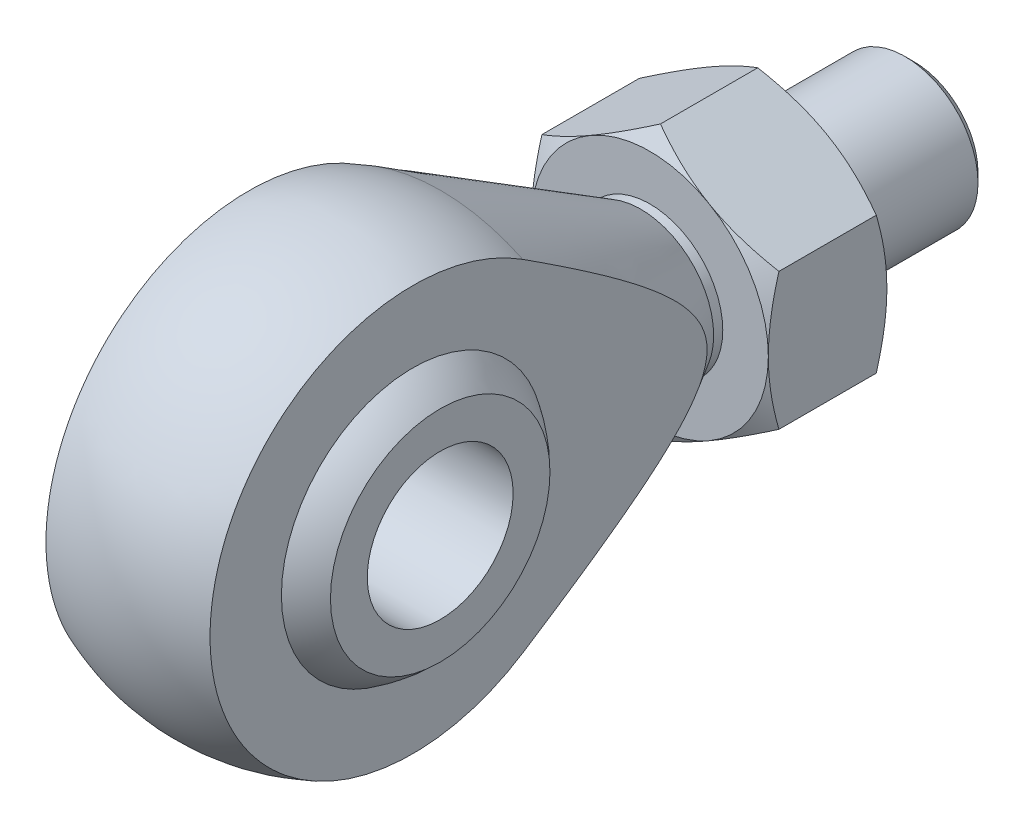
ISO-10303-21;
HEADER;
FILE_DESCRIPTION(('STEP AP214'),'2;1');
FILE_NAME('part.step','',(''),(''),'','','');
FILE_SCHEMA(('AUTOMOTIVE_DESIGN { 1 0 10303 214 1 1 1 1 }'));
ENDSEC;
DATA;
#1=APPLICATION_CONTEXT('core data for automotive mechanical design processes');
#2=APPLICATION_PROTOCOL_DEFINITION('international standard','automotive_design',2000,#1);
#3=PRODUCT_CONTEXT('',#1,'mechanical');
#4=PRODUCT('Part','Part','',(#3));
#5=PRODUCT_RELATED_PRODUCT_CATEGORY('part','',(#4));
#6=PRODUCT_DEFINITION_FORMATION('','',#4);
#7=PRODUCT_DEFINITION_CONTEXT('part definition',#1,'design');
#8=PRODUCT_DEFINITION('design','',#6,#7);
#9=PRODUCT_DEFINITION_SHAPE('','',#8);
#10=(LENGTH_UNIT() NAMED_UNIT(*) SI_UNIT(.MILLI.,.METRE.));
#11=(NAMED_UNIT(*) PLANE_ANGLE_UNIT() SI_UNIT($,.RADIAN.));
#12=(NAMED_UNIT(*) SI_UNIT($,.STERADIAN.) SOLID_ANGLE_UNIT());
#13=UNCERTAINTY_MEASURE_WITH_UNIT(LENGTH_MEASURE(1.E-05),#10,'distance_accuracy_value','');
#14=(GEOMETRIC_REPRESENTATION_CONTEXT(3) GLOBAL_UNCERTAINTY_ASSIGNED_CONTEXT((#13)) GLOBAL_UNIT_ASSIGNED_CONTEXT((#10,
#11,#12)) REPRESENTATION_CONTEXT('',''));
#15=CARTESIAN_POINT('',(0.,0.,0.));
#16=DIRECTION('',(0.,0.,1.));
#17=DIRECTION('',(1.,0.,0.));
#18=AXIS2_PLACEMENT_3D('',#15,#16,#17);
#19=CARTESIAN_POINT('',(-6.5,11.2583302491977,-17.5));
#20=DIRECTION('',(0.,0.,-1.));
#21=DIRECTION('',(-1.,0.,0.));
#22=AXIS2_PLACEMENT_3D('',#19,#20,#21);
#23=PLANE('',#22);
#24=CARTESIAN_POINT('',(0.,0.,-17.5));
#25=DIRECTION('',(0.,0.,1.));
#26=DIRECTION('',(1.,0.,0.));
#27=AXIS2_PLACEMENT_3D('',#24,#25,#26);
#28=CIRCLE('',#27,4.);
#29=CARTESIAN_POINT('',(4.,0.,-17.5));
#30=VERTEX_POINT('',#29);
#31=EDGE_CURVE('E330',#30,#30,#28,.T.);
#32=ORIENTED_EDGE('',*,*,#31,.F.);
#33=EDGE_LOOP('',(#32));
#34=FACE_BOUND('',#33,.T.);
#35=CARTESIAN_POINT('',(0.,0.,-17.5));
#36=DIRECTION('',(0.,0.,-1.));
#37=DIRECTION('',(-1.,0.,0.));
#38=AXIS2_PLACEMENT_3D('',#35,#36,#37);
#39=CIRCLE('',#38,6.5);
#40=CARTESIAN_POINT('',(-6.5,0.,-17.5));
#41=VERTEX_POINT('',#40);
#42=CARTESIAN_POINT('',(-3.25,5.62916512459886,-17.5));
#43=VERTEX_POINT('',#42);
#44=EDGE_CURVE('E338',#41,#43,#39,.T.);
#45=ORIENTED_EDGE('',*,*,#44,.F.);
#46=CARTESIAN_POINT('',(0.,0.,-17.5));
#47=DIRECTION('',(0.,0.,-1.));
#48=DIRECTION('',(-1.,0.,0.));
#49=AXIS2_PLACEMENT_3D('',#46,#47,#48);
#50=CIRCLE('',#49,6.5);
#51=CARTESIAN_POINT('',(-3.25,-5.62916512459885,-17.5));
#52=VERTEX_POINT('',#51);
#53=EDGE_CURVE('E160',#41,#52,#50,.F.);
#54=ORIENTED_EDGE('',*,*,#53,.T.);
#55=CARTESIAN_POINT('',(3.25,-5.62916512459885,-17.5));
#56=VERTEX_POINT('',#55);
#57=EDGE_CURVE('E262',#52,#56,#50,.F.);
#58=ORIENTED_EDGE('',*,*,#57,.T.);
#59=CARTESIAN_POINT('',(6.5,0.,-17.5));
#60=VERTEX_POINT('',#59);
#61=EDGE_CURVE('E163',#56,#60,#50,.F.);
#62=ORIENTED_EDGE('',*,*,#61,.T.);
#63=CARTESIAN_POINT('',(3.25,5.62916512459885,-17.5));
#64=VERTEX_POINT('',#63);
#65=EDGE_CURVE('E138',#60,#64,#50,.F.);
#66=ORIENTED_EDGE('',*,*,#65,.T.);
#67=EDGE_CURVE('E151',#64,#43,#50,.F.);
#68=ORIENTED_EDGE('',*,*,#67,.T.);
#69=EDGE_LOOP('',(#45,#54,#58,#62,#66,#68));
#70=FACE_BOUND('',#69,.T.);
#71=ADVANCED_FACE('F43',(#34,#70),#23,.F.);
#72=CARTESIAN_POINT('',(0.,0.,-17.5));
#73=DIRECTION('',(0.,0.,-1.));
#74=DIRECTION('',(-1.,0.,0.));
#75=AXIS2_PLACEMENT_3D('',#72,#73,#74);
#76=CONICAL_SURFACE('',#75,6.5,1.0471975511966);
#77=CARTESIAN_POINT('',(-6.5,-10.0985149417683,-20.6809573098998));
#78=CARTESIAN_POINT('',(-6.5,-9.81442448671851,-20.5430753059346));
#79=CARTESIAN_POINT('',(-6.5,-9.52968373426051,-20.4065103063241));
#80=CARTESIAN_POINT('',(-6.5,-8.95855580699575,-20.1367548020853));
#81=CARTESIAN_POINT('',(-6.5,-8.67216838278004,-20.0035648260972));
#82=CARTESIAN_POINT('',(-6.5,-8.09593488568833,-19.7406338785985));
#83=CARTESIAN_POINT('',(-6.5,-7.80607848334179,-19.6109154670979));
#84=CARTESIAN_POINT('',(-6.5,-7.22406608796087,-19.3567643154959));
#85=CARTESIAN_POINT('',(-6.5,-6.93191020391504,-19.2323313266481));
#86=CARTESIAN_POINT('',(-6.5,-6.33541861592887,-18.9862618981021));
#87=CARTESIAN_POINT('',(-6.5,-6.03099269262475,-18.864842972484));
#88=CARTESIAN_POINT('',(-6.5,-5.41858592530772,-18.6311509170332));
#89=CARTESIAN_POINT('',(-6.5,-5.11060468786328,-18.5188788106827));
#90=CARTESIAN_POINT('',(-6.5,-4.49116870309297,-18.3064135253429));
#91=CARTESIAN_POINT('',(-6.5,-4.17972236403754,-18.2061960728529));
#92=CARTESIAN_POINT('',(-6.5,-3.55235928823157,-18.0210446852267));
#93=CARTESIAN_POINT('',(-6.5,-3.23644398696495,-17.9361059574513));
#94=CARTESIAN_POINT('',(-6.5,-2.6016924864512,-17.7860140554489));
#95=CARTESIAN_POINT('',(-6.5,-2.28288159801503,-17.7207555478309));
#96=CARTESIAN_POINT('',(-6.5,-1.64123192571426,-17.6137306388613));
#97=CARTESIAN_POINT('',(-6.5,-1.31839354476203,-17.5719619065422));
#98=CARTESIAN_POINT('',(-6.5,-0.834548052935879,-17.5296987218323));
#99=CARTESIAN_POINT('',(-6.5,-0.674391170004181,-17.5190142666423));
#100=CARTESIAN_POINT('',(-6.5,-0.353761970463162,-17.5044228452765));
#101=CARTESIAN_POINT('',(-6.5,-0.19328965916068,-17.5005157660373));
#102=CARTESIAN_POINT('',(-6.5,0.127675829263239,-17.4995798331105));
#103=CARTESIAN_POINT('',(-6.5,0.288169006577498,-17.5025510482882));
#104=CARTESIAN_POINT('',(-6.5,0.608887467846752,-17.5152969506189));
#105=CARTESIAN_POINT('',(-6.5,0.769112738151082,-17.5250719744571));
#106=CARTESIAN_POINT('',(-6.5,1.15356140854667,-17.5564825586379));
#107=CARTESIAN_POINT('',(-6.5,1.37752936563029,-17.5813118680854));
#108=CARTESIAN_POINT('',(-6.5,1.82380504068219,-17.6429156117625));
#109=CARTESIAN_POINT('',(-6.5,2.04611253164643,-17.6796916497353));
#110=CARTESIAN_POINT('',(-6.5,2.71028289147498,-17.8059899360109));
#111=CARTESIAN_POINT('',(-6.5,3.14915331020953,-17.9114601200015));
#112=CARTESIAN_POINT('',(-6.5,3.80555173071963,-18.0944194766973));
#113=CARTESIAN_POINT('',(-6.5,4.02648029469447,-18.1604100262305));
#114=CARTESIAN_POINT('',(-6.5,4.46619094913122,-18.299255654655));
#115=CARTESIAN_POINT('',(-6.5,4.68497302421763,-18.3721107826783));
#116=CARTESIAN_POINT('',(-6.5,5.12046127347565,-18.5235154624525));
#117=CARTESIAN_POINT('',(-6.5,5.33716808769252,-18.6020631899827));
#118=CARTESIAN_POINT('',(-6.5,5.76878342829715,-18.7639275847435));
#119=CARTESIAN_POINT('',(-6.5,5.98369198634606,-18.8472441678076));
#120=CARTESIAN_POINT('',(-6.5,6.5321333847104,-19.0657470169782));
#121=CARTESIAN_POINT('',(-6.5,6.86452551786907,-19.2037927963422));
#122=CARTESIAN_POINT('',(-6.5,7.52616114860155,-19.4872582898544));
#123=CARTESIAN_POINT('',(-6.5,7.85540437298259,-19.6326786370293));
#124=CARTESIAN_POINT('',(-6.5,8.51141095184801,-19.9292537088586));
#125=CARTESIAN_POINT('',(-6.5,8.8381735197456,-20.080410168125));
#126=CARTESIAN_POINT('',(-6.5,9.48958511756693,-20.3871718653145));
#127=CARTESIAN_POINT('',(-6.5,9.81423421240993,-20.5427769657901));
#128=CARTESIAN_POINT('',(-6.5,10.4622514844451,-20.8577338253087));
#129=CARTESIAN_POINT('',(-6.5,10.7856173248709,-21.0170903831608));
#130=CARTESIAN_POINT('',(-6.5,11.4309268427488,-21.338657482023));
#131=CARTESIAN_POINT('',(-6.5,11.7528705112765,-21.5008680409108));
#132=CARTESIAN_POINT('',(-6.5,12.7168301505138,-21.9908961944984));
#133=CARTESIAN_POINT('',(-6.5,13.357090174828,-22.322166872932));
#134=CARTESIAN_POINT('',(-6.5,14.5727884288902,-22.9587664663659));
#135=CARTESIAN_POINT('',(-6.5,15.1485293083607,-23.2635201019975));
#136=CARTESIAN_POINT('',(-6.5,16.2980144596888,-23.8768344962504));
#137=CARTESIAN_POINT('',(-6.5,16.8717586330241,-24.185395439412));
#138=CARTESIAN_POINT('',(-6.5,18.0160290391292,-24.8044593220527));
#139=CARTESIAN_POINT('',(-6.5,18.5865597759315,-25.1149539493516));
#140=CARTESIAN_POINT('',(-6.5,19.7263670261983,-25.7381480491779));
#141=CARTESIAN_POINT('',(-6.5,20.2956436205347,-26.0508473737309));
#142=CARTESIAN_POINT('',(-6.5,20.8644710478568,-26.3643564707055));
#143=B_SPLINE_CURVE_WITH_KNOTS('',3,(#77,#78,#79,#80,#81,#82,#83,#84,#85,#86,#87,#88,#89,#90,
#91,#92,#93,#94,#95,#96,#97,#98,#99,#100,#101,#102,#103,#104,#105,#106,#107,#108,#109,#110,#111,
#112,#113,#114,#115,#116,#117,#118,#119,#120,#121,#122,#123,#124,#125,#126,#127,#128,#129,#130,
#131,#132,#133,#134,#135,#136,#137,#138,#139,#140,#141,#142),.UNSPECIFIED.,.F.,.F.,(4,2,2,2,2,2,
2,2,2,2,2,2,2,2,2,2,2,2,2,2,2,2,2,2,2,2,2,2,2,2,2,2,4),(0.,0.947360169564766,1.89486782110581,
2.84750200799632,3.80009131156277,4.78321700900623,5.76645256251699,6.74767387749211,
7.72858686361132,8.70415257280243,9.67962145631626,10.1610384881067,10.6424474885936,
11.1238613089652,11.6052989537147,12.2809380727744,12.9566679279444,14.3088484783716,
15.0005111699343,15.6921788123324,16.3836257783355,17.0750605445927,18.1546874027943,
19.2344070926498,20.3144559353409,21.3944714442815,22.4759529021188,23.5574411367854,
25.7200319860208,27.6742871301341,29.628637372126,31.5772753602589,33.5257837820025),.UNSPECIFIED.);
#144=CARTESIAN_POINT('',(-6.5,3.75277674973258,-18.0805565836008));
#145=VERTEX_POINT('',#144);
#146=EDGE_CURVE('E168',#145,#41,#143,.F.);
#147=ORIENTED_EDGE('',*,*,#146,.T.);
#148=ORIENTED_EDGE('',*,*,#44,.T.);
#149=CARTESIAN_POINT('',(0.000200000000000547,7.50566896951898,-18.0806232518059));
#150=CARTESIAN_POINT('',(-0.14267745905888,7.42317863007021,-18.0330044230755));
#151=CARTESIAN_POINT('',(-0.286087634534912,7.34038072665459,-17.9875467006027));
#152=CARTESIAN_POINT('',(-0.574072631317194,7.17411251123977,-17.901548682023));
#153=CARTESIAN_POINT('',(-0.718647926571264,7.09064192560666,-17.861010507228));
#154=CARTESIAN_POINT('',(-1.15468865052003,6.8388936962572,-17.7475710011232));
#155=CARTESIAN_POINT('',(-1.44787528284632,6.66962231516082,-17.6830478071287));
#156=CARTESIAN_POINT('',(-1.88662374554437,6.41631077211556,-17.6073865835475));
#157=CARTESIAN_POINT('',(-2.03087463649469,6.33302748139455,-17.585832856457));
#158=CARTESIAN_POINT('',(-2.32002821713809,6.16608458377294,-17.5496903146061));
#159=CARTESIAN_POINT('',(-2.46493084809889,6.08242501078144,-17.5351008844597));
#160=CARTESIAN_POINT('',(-2.75498777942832,5.91496056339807,-17.5132587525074));
#161=CARTESIAN_POINT('',(-2.90014160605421,5.83115596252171,-17.5059977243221));
#162=CARTESIAN_POINT('',(-3.19057533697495,5.66347396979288,-17.4989603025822));
#163=CARTESIAN_POINT('',(-3.33585523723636,5.57959658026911,-17.4991836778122));
#164=CARTESIAN_POINT('',(-3.7338759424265,5.34979921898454,-17.5100834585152));
#165=CARTESIAN_POINT('',(-3.98648646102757,5.20395446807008,-17.5283818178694));
#166=CARTESIAN_POINT('',(-4.49002967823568,4.91323365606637,-17.5864063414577));
#167=CARTESIAN_POINT('',(-4.74096060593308,4.76835861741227,-17.6261523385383));
#168=CARTESIAN_POINT('',(-5.24551722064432,4.47705272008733,-17.7255059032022));
#169=CARTESIAN_POINT('',(-5.49907924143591,4.33065861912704,-17.785534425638));
#170=CARTESIAN_POINT('',(-6.00242193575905,4.04005357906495,-17.9217749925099));
#171=CARTESIAN_POINT('',(-6.25220905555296,3.89583891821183,-17.9979550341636));
#172=CARTESIAN_POINT('',(-6.5002,3.75266127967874,-18.0806232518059));
#173=B_SPLINE_CURVE_WITH_KNOTS('',3,(#149,#150,#151,#152,#153,#154,#155,#156,#157,#158,#159,
#160,#161,#162,#163,#164,#165,#166,#167,#168,#169,#170,#171,#172),.UNSPECIFIED.,.F.,.F.,(4,2,2,
2,2,2,2,2,2,2,2,4),(0.,0.515105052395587,1.03043143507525,2.06322554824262,2.56697389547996,
3.07067772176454,3.57380860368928,4.0769239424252,4.9527935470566,5.82947446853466,
6.72559912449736,7.61996451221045),.UNSPECIFIED.);
#174=EDGE_CURVE('E200',#43,#145,#173,.T.);
#175=ORIENTED_EDGE('',*,*,#174,.T.);
#176=EDGE_LOOP('',(#147,#148,#175));
#177=FACE_BOUND('',#176,.T.);
#178=ADVANCED_FACE('F187',(#177),#76,.T.);
#179=CARTESIAN_POINT('',(6.5002,3.75266127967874,-18.0806232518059));
#180=CARTESIAN_POINT('',(6.35732254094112,3.83515161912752,-18.0330044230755));
#181=CARTESIAN_POINT('',(6.21391236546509,3.91794952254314,-17.9875467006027));
#182=CARTESIAN_POINT('',(5.92592736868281,4.08421773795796,-17.901548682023));
#183=CARTESIAN_POINT('',(5.78135207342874,4.16768832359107,-17.861010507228));
#184=CARTESIAN_POINT('',(5.34531134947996,4.41943655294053,-17.7475710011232));
#185=CARTESIAN_POINT('',(5.05212471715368,4.58870793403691,-17.6830478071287));
#186=CARTESIAN_POINT('',(4.61337625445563,4.84201947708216,-17.6073865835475));
#187=CARTESIAN_POINT('',(4.46912536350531,4.92530276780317,-17.585832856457));
#188=CARTESIAN_POINT('',(4.17997178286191,5.09224566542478,-17.5496903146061));
#189=CARTESIAN_POINT('',(4.03506915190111,5.17590523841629,-17.5351008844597));
#190=CARTESIAN_POINT('',(3.74501222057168,5.34336968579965,-17.5132587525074));
#191=CARTESIAN_POINT('',(3.59985839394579,5.42717428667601,-17.5059977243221));
#192=CARTESIAN_POINT('',(3.30942466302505,5.59485627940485,-17.4989603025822));
#193=CARTESIAN_POINT('',(3.16414476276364,5.67873366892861,-17.4991836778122));
#194=CARTESIAN_POINT('',(2.7661240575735,5.90853103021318,-17.5100834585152));
#195=CARTESIAN_POINT('',(2.51351353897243,6.05437578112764,-17.5283818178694));
#196=CARTESIAN_POINT('',(2.00997032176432,6.34509659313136,-17.5864063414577));
#197=CARTESIAN_POINT('',(1.75903939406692,6.48997163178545,-17.6261523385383));
#198=CARTESIAN_POINT('',(1.25448277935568,6.78127752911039,-17.7255059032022));
#199=CARTESIAN_POINT('',(1.00092075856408,6.92767163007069,-17.785534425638));
#200=CARTESIAN_POINT('',(0.497578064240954,7.21827667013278,-17.9217749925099));
#201=CARTESIAN_POINT('',(0.247790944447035,7.3624913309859,-17.9979550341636));
#202=CARTESIAN_POINT('',(-0.000200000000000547,7.50566896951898,-18.0806232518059));
#203=B_SPLINE_CURVE_WITH_KNOTS('',3,(#179,#180,#181,#182,#183,#184,#185,#186,#187,#188,#189,
#190,#191,#192,#193,#194,#195,#196,#197,#198,#199,#200,#201,#202),.UNSPECIFIED.,.F.,.F.,(4,2,2,
2,2,2,2,2,2,2,2,4),(0.,0.515105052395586,1.03043143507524,2.06322554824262,2.56697389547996,
3.07067772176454,3.57380860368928,4.0769239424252,4.9527935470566,5.82947446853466,
6.72559912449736,7.61996451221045),.UNSPECIFIED.);
#204=CARTESIAN_POINT('',(0.,7.50555349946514,-18.0805565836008));
#205=VERTEX_POINT('',#204);
#206=EDGE_CURVE('E147',#64,#205,#203,.T.);
#207=ORIENTED_EDGE('',*,*,#206,.T.);
#208=EDGE_CURVE('E154',#205,#43,#173,.T.);
#209=ORIENTED_EDGE('',*,*,#208,.T.);
#210=ORIENTED_EDGE('',*,*,#67,.F.);
#211=EDGE_LOOP('',(#207,#209,#210));
#212=FACE_BOUND('',#211,.T.);
#213=ADVANCED_FACE('F152',(#212),#76,.T.);
#214=CARTESIAN_POINT('',(6.5,-10.0985149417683,-20.6809573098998));
#215=CARTESIAN_POINT('',(6.5,-9.81442448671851,-20.5430753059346));
#216=CARTESIAN_POINT('',(6.5,-9.52968373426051,-20.4065103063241));
#217=CARTESIAN_POINT('',(6.5,-8.95855580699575,-20.1367548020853));
#218=CARTESIAN_POINT('',(6.5,-8.67216838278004,-20.0035648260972));
#219=CARTESIAN_POINT('',(6.5,-8.09593488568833,-19.7406338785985));
#220=CARTESIAN_POINT('',(6.5,-7.80607848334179,-19.6109154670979));
#221=CARTESIAN_POINT('',(6.5,-7.22406608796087,-19.3567643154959));
#222=CARTESIAN_POINT('',(6.5,-6.93191020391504,-19.2323313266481));
#223=CARTESIAN_POINT('',(6.5,-6.33541861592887,-18.9862618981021));
#224=CARTESIAN_POINT('',(6.5,-6.03099269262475,-18.864842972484));
#225=CARTESIAN_POINT('',(6.5,-5.41858592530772,-18.6311509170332));
#226=CARTESIAN_POINT('',(6.5,-5.11060468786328,-18.5188788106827));
#227=CARTESIAN_POINT('',(6.5,-4.49116870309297,-18.3064135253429));
#228=CARTESIAN_POINT('',(6.5,-4.17972236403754,-18.2061960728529));
#229=CARTESIAN_POINT('',(6.5,-3.55235928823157,-18.0210446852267));
#230=CARTESIAN_POINT('',(6.5,-3.23644398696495,-17.9361059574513));
#231=CARTESIAN_POINT('',(6.5,-2.6016924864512,-17.7860140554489));
#232=CARTESIAN_POINT('',(6.5,-2.28288159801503,-17.7207555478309));
#233=CARTESIAN_POINT('',(6.5,-1.64123192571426,-17.6137306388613));
#234=CARTESIAN_POINT('',(6.5,-1.31839354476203,-17.5719619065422));
#235=CARTESIAN_POINT('',(6.5,-0.834548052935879,-17.5296987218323));
#236=CARTESIAN_POINT('',(6.5,-0.674391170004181,-17.5190142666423));
#237=CARTESIAN_POINT('',(6.5,-0.353761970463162,-17.5044228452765));
#238=CARTESIAN_POINT('',(6.5,-0.19328965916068,-17.5005157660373));
#239=CARTESIAN_POINT('',(6.5,0.127675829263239,-17.4995798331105));
#240=CARTESIAN_POINT('',(6.5,0.288169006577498,-17.5025510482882));
#241=CARTESIAN_POINT('',(6.5,0.608887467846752,-17.5152969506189));
#242=CARTESIAN_POINT('',(6.5,0.769112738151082,-17.5250719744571));
#243=CARTESIAN_POINT('',(6.5,1.15356140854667,-17.5564825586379));
#244=CARTESIAN_POINT('',(6.5,1.37752936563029,-17.5813118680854));
#245=CARTESIAN_POINT('',(6.5,1.82380504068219,-17.6429156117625));
#246=CARTESIAN_POINT('',(6.5,2.04611253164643,-17.6796916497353));
#247=CARTESIAN_POINT('',(6.5,2.71028289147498,-17.8059899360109));
#248=CARTESIAN_POINT('',(6.5,3.14915331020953,-17.9114601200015));
#249=CARTESIAN_POINT('',(6.5,3.80555173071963,-18.0944194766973));
#250=CARTESIAN_POINT('',(6.5,4.02648029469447,-18.1604100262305));
#251=CARTESIAN_POINT('',(6.5,4.46619094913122,-18.299255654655));
#252=CARTESIAN_POINT('',(6.5,4.68497302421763,-18.3721107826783));
#253=CARTESIAN_POINT('',(6.5,5.12046127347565,-18.5235154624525));
#254=CARTESIAN_POINT('',(6.5,5.33716808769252,-18.6020631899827));
#255=CARTESIAN_POINT('',(6.5,5.76878342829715,-18.7639275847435));
#256=CARTESIAN_POINT('',(6.5,5.98369198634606,-18.8472441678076));
#257=CARTESIAN_POINT('',(6.5,6.5321333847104,-19.0657470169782));
#258=CARTESIAN_POINT('',(6.5,6.86452551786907,-19.2037927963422));
#259=CARTESIAN_POINT('',(6.5,7.52616114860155,-19.4872582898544));
#260=CARTESIAN_POINT('',(6.5,7.85540437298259,-19.6326786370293));
#261=CARTESIAN_POINT('',(6.5,8.51141095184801,-19.9292537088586));
#262=CARTESIAN_POINT('',(6.5,8.8381735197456,-20.080410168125));
#263=CARTESIAN_POINT('',(6.5,9.48958511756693,-20.3871718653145));
#264=CARTESIAN_POINT('',(6.5,9.81423421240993,-20.5427769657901));
#265=CARTESIAN_POINT('',(6.5,10.4622514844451,-20.8577338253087));
#266=CARTESIAN_POINT('',(6.5,10.7856173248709,-21.0170903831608));
#267=CARTESIAN_POINT('',(6.5,11.4309268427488,-21.338657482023));
#268=CARTESIAN_POINT('',(6.5,11.7528705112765,-21.5008680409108));
#269=CARTESIAN_POINT('',(6.5,12.7168301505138,-21.9908961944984));
#270=CARTESIAN_POINT('',(6.5,13.357090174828,-22.322166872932));
#271=CARTESIAN_POINT('',(6.5,14.5727884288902,-22.9587664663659));
#272=CARTESIAN_POINT('',(6.5,15.1485293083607,-23.2635201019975));
#273=CARTESIAN_POINT('',(6.5,16.2980144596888,-23.8768344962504));
#274=CARTESIAN_POINT('',(6.5,16.8717586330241,-24.185395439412));
#275=CARTESIAN_POINT('',(6.5,18.0160290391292,-24.8044593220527));
#276=CARTESIAN_POINT('',(6.5,18.5865597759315,-25.1149539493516));
#277=CARTESIAN_POINT('',(6.5,19.7263670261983,-25.7381480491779));
#278=CARTESIAN_POINT('',(6.5,20.2956436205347,-26.0508473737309));
#279=CARTESIAN_POINT('',(6.5,20.8644710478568,-26.3643564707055));
#280=B_SPLINE_CURVE_WITH_KNOTS('',3,(#214,#215,#216,#217,#218,#219,#220,#221,#222,#223,#224,
#225,#226,#227,#228,#229,#230,#231,#232,#233,#234,#235,#236,#237,#238,#239,#240,#241,#242,#243,
#244,#245,#246,#247,#248,#249,#250,#251,#252,#253,#254,#255,#256,#257,#258,#259,#260,#261,#262,
#263,#264,#265,#266,#267,#268,#269,#270,#271,#272,#273,#274,#275,#276,#277,#278,#279),
.UNSPECIFIED.,.F.,.F.,(4,2,2,2,2,2,2,2,2,2,2,2,2,2,2,2,2,2,2,2,2,2,2,2,2,2,2,2,2,2,2,2,4),(0.,
0.947360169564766,1.89486782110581,2.84750200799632,3.80009131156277,4.78321700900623,
5.76645256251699,6.74767387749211,7.72858686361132,8.70415257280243,9.67962145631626,
10.1610384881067,10.6424474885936,11.1238613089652,11.6052989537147,12.2809380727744,
12.9566679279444,14.3088484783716,15.0005111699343,15.6921788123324,16.3836257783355,
17.0750605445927,18.1546874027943,19.2344070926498,20.3144559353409,21.3944714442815,
22.4759529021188,23.5574411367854,25.7200319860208,27.6742871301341,29.628637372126,
31.5772753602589,33.5257837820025),.UNSPECIFIED.);
#281=CARTESIAN_POINT('',(6.5,3.75277674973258,-18.0805565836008));
#282=VERTEX_POINT('',#281);
#283=EDGE_CURVE('E141',#60,#282,#280,.T.);
#284=ORIENTED_EDGE('',*,*,#283,.T.);
#285=EDGE_CURVE('E134',#282,#64,#203,.T.);
#286=ORIENTED_EDGE('',*,*,#285,.T.);
#287=ORIENTED_EDGE('',*,*,#65,.F.);
#288=EDGE_LOOP('',(#284,#286,#287));
#289=FACE_BOUND('',#288,.T.);
#290=ADVANCED_FACE('F136',(#289),#76,.T.);
#291=CARTESIAN_POINT('',(-0.000200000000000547,-7.50566896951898,-18.0806232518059));
#292=CARTESIAN_POINT('',(0.14267745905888,-7.42317863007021,-18.0330044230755));
#293=CARTESIAN_POINT('',(0.286087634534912,-7.34038072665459,-17.9875467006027));
#294=CARTESIAN_POINT('',(0.574072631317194,-7.17411251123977,-17.901548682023));
#295=CARTESIAN_POINT('',(0.718647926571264,-7.09064192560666,-17.861010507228));
#296=CARTESIAN_POINT('',(1.15468865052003,-6.8388936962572,-17.7475710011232));
#297=CARTESIAN_POINT('',(1.44787528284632,-6.66962231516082,-17.6830478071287));
#298=CARTESIAN_POINT('',(1.88662374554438,-6.41631077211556,-17.6073865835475));
#299=CARTESIAN_POINT('',(2.03087463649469,-6.33302748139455,-17.585832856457));
#300=CARTESIAN_POINT('',(2.32002821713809,-6.16608458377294,-17.5496903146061));
#301=CARTESIAN_POINT('',(2.46493084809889,-6.08242501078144,-17.5351008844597));
#302=CARTESIAN_POINT('',(2.75498777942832,-5.91496056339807,-17.5132587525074));
#303=CARTESIAN_POINT('',(2.90014160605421,-5.83115596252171,-17.5059977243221));
#304=CARTESIAN_POINT('',(3.19057533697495,-5.66347396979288,-17.4989603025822));
#305=CARTESIAN_POINT('',(3.33585523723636,-5.57959658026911,-17.4991836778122));
#306=CARTESIAN_POINT('',(3.7338759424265,-5.34979921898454,-17.5100834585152));
#307=CARTESIAN_POINT('',(3.98648646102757,-5.20395446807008,-17.5283818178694));
#308=CARTESIAN_POINT('',(4.49002967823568,-4.91323365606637,-17.5864063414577));
#309=CARTESIAN_POINT('',(4.74096060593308,-4.76835861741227,-17.6261523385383));
#310=CARTESIAN_POINT('',(5.24551722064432,-4.47705272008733,-17.7255059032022));
#311=CARTESIAN_POINT('',(5.49907924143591,-4.33065861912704,-17.785534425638));
#312=CARTESIAN_POINT('',(6.00242193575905,-4.04005357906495,-17.9217749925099));
#313=CARTESIAN_POINT('',(6.25220905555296,-3.89583891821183,-17.9979550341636));
#314=CARTESIAN_POINT('',(6.5002,-3.75266127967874,-18.0806232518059));
#315=B_SPLINE_CURVE_WITH_KNOTS('',3,(#291,#292,#293,#294,#295,#296,#297,#298,#299,#300,#301,
#302,#303,#304,#305,#306,#307,#308,#309,#310,#311,#312,#313,#314),.UNSPECIFIED.,.F.,.F.,(4,2,2,
2,2,2,2,2,2,2,2,4),(0.,0.515105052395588,1.03043143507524,2.06322554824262,2.56697389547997,
3.07067772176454,3.57380860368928,4.0769239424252,4.9527935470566,5.82947446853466,
6.72559912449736,7.61996451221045),.UNSPECIFIED.);
#316=CARTESIAN_POINT('',(6.5,-3.75277674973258,-18.0805565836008));
#317=VERTEX_POINT('',#316);
#318=EDGE_CURVE('E214',#56,#317,#315,.T.);
#319=ORIENTED_EDGE('',*,*,#318,.T.);
#320=EDGE_CURVE('E213',#317,#60,#280,.T.);
#321=ORIENTED_EDGE('',*,*,#320,.T.);
#322=ORIENTED_EDGE('',*,*,#61,.F.);
#323=EDGE_LOOP('',(#319,#321,#322));
#324=FACE_BOUND('',#323,.T.);
#325=ADVANCED_FACE('F437',(#324),#76,.T.);
#326=CARTESIAN_POINT('',(0.,-7.50555349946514,-18.0805565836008));
#327=VERTEX_POINT('',#326);
#328=EDGE_CURVE('E272',#327,#56,#315,.T.);
#329=ORIENTED_EDGE('',*,*,#328,.T.);
#330=ORIENTED_EDGE('',*,*,#57,.F.);
#331=CARTESIAN_POINT('',(-6.5002,-3.75266127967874,-18.0806232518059));
#332=CARTESIAN_POINT('',(-6.35732254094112,-3.83515161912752,-18.0330044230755));
#333=CARTESIAN_POINT('',(-6.21391236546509,-3.91794952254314,-17.9875467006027));
#334=CARTESIAN_POINT('',(-5.92592736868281,-4.08421773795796,-17.901548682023));
#335=CARTESIAN_POINT('',(-5.78135207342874,-4.16768832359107,-17.861010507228));
#336=CARTESIAN_POINT('',(-5.34531134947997,-4.41943655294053,-17.7475710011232));
#337=CARTESIAN_POINT('',(-5.05212471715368,-4.58870793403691,-17.6830478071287));
#338=CARTESIAN_POINT('',(-4.61337625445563,-4.84201947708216,-17.6073865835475));
#339=CARTESIAN_POINT('',(-4.46912536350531,-4.92530276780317,-17.585832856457));
#340=CARTESIAN_POINT('',(-4.17997178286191,-5.09224566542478,-17.5496903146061));
#341=CARTESIAN_POINT('',(-4.03506915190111,-5.17590523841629,-17.5351008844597));
#342=CARTESIAN_POINT('',(-3.74501222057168,-5.34336968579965,-17.5132587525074));
#343=CARTESIAN_POINT('',(-3.59985839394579,-5.42717428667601,-17.5059977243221));
#344=CARTESIAN_POINT('',(-3.30942466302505,-5.59485627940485,-17.4989603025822));
#345=CARTESIAN_POINT('',(-3.16414476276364,-5.67873366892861,-17.4991836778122));
#346=CARTESIAN_POINT('',(-2.7661240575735,-5.90853103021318,-17.5100834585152));
#347=CARTESIAN_POINT('',(-2.51351353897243,-6.05437578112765,-17.5283818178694));
#348=CARTESIAN_POINT('',(-2.00997032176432,-6.34509659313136,-17.5864063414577));
#349=CARTESIAN_POINT('',(-1.75903939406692,-6.48997163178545,-17.6261523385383));
#350=CARTESIAN_POINT('',(-1.25448277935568,-6.78127752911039,-17.7255059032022));
#351=CARTESIAN_POINT('',(-1.00092075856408,-6.92767163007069,-17.785534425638));
#352=CARTESIAN_POINT('',(-0.497578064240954,-7.21827667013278,-17.9217749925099));
#353=CARTESIAN_POINT('',(-0.247790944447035,-7.3624913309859,-17.9979550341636));
#354=CARTESIAN_POINT('',(0.000200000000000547,-7.50566896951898,-18.0806232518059));
#355=B_SPLINE_CURVE_WITH_KNOTS('',3,(#331,#332,#333,#334,#335,#336,#337,#338,#339,#340,#341,
#342,#343,#344,#345,#346,#347,#348,#349,#350,#351,#352,#353,#354),.UNSPECIFIED.,.F.,.F.,(4,2,2,
2,2,2,2,2,2,2,2,4),(0.,0.515105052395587,1.03043143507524,2.06322554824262,2.56697389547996,
3.07067772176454,3.57380860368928,4.0769239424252,4.9527935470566,5.82947446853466,
6.72559912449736,7.61996451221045),.UNSPECIFIED.);
#356=EDGE_CURVE('E276',#52,#327,#355,.T.);
#357=ORIENTED_EDGE('',*,*,#356,.T.);
#358=EDGE_LOOP('',(#329,#330,#357));
#359=FACE_BOUND('',#358,.T.);
#360=ADVANCED_FACE('F193',(#359),#76,.T.);
#361=CARTESIAN_POINT('',(-6.5,-3.75277674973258,-18.0805565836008));
#362=VERTEX_POINT('',#361);
#363=EDGE_CURVE('E181',#362,#52,#355,.T.);
#364=ORIENTED_EDGE('',*,*,#363,.T.);
#365=ORIENTED_EDGE('',*,*,#53,.F.);
#366=EDGE_CURVE('E146',#41,#362,#143,.F.);
#367=ORIENTED_EDGE('',*,*,#366,.T.);
#368=EDGE_LOOP('',(#364,#365,#367));
#369=FACE_BOUND('',#368,.T.);
#370=ADVANCED_FACE('F281',(#369),#76,.T.);
#371=CARTESIAN_POINT('',(6.5,3.75277674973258,-24.));
#372=DIRECTION('',(0.5,0.866025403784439,0.));
#373=DIRECTION('',(-0.866025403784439,0.5,0.));
#374=AXIS2_PLACEMENT_3D('',#371,#372,#373);
#375=PLANE('',#374);
#376=CARTESIAN_POINT('',(-0.000200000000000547,7.50566896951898,-23.4193767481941));
#377=CARTESIAN_POINT('',(0.14267745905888,7.42317863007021,-23.4669955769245));
#378=CARTESIAN_POINT('',(0.286087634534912,7.34038072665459,-23.5124532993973));
#379=CARTESIAN_POINT('',(0.574072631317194,7.17411251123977,-23.598451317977));
#380=CARTESIAN_POINT('',(0.718647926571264,7.09064192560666,-23.638989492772));
#381=CARTESIAN_POINT('',(1.15468865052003,6.8388936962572,-23.7524289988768));
#382=CARTESIAN_POINT('',(1.44787528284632,6.66962231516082,-23.8169521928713));
#383=CARTESIAN_POINT('',(1.88662374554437,6.41631077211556,-23.8926134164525));
#384=CARTESIAN_POINT('',(2.03087463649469,6.33302748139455,-23.914167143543));
#385=CARTESIAN_POINT('',(2.32002821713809,6.16608458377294,-23.9503096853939));
#386=CARTESIAN_POINT('',(2.46493084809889,6.08242501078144,-23.9648991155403));
#387=CARTESIAN_POINT('',(2.75498777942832,5.91496056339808,-23.9867412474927));
#388=CARTESIAN_POINT('',(2.90014160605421,5.83115596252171,-23.9940022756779));
#389=CARTESIAN_POINT('',(3.19057533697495,5.66347396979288,-24.0010396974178));
#390=CARTESIAN_POINT('',(3.33585523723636,5.57959658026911,-24.0008163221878));
#391=CARTESIAN_POINT('',(3.7338759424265,5.34979921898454,-23.9899165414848));
#392=CARTESIAN_POINT('',(3.98648646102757,5.20395446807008,-23.9716181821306));
#393=CARTESIAN_POINT('',(4.49002967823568,4.91323365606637,-23.9135936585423));
#394=CARTESIAN_POINT('',(4.74096060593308,4.76835861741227,-23.8738476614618));
#395=CARTESIAN_POINT('',(5.24551722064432,4.47705272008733,-23.7744940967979));
#396=CARTESIAN_POINT('',(5.49907924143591,4.33065861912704,-23.714465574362));
#397=CARTESIAN_POINT('',(6.00242193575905,4.04005357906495,-23.5782250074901));
#398=CARTESIAN_POINT('',(6.25220905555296,3.89583891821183,-23.5020449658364));
#399=CARTESIAN_POINT('',(6.5002,3.75266127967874,-23.4193767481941));
#400=B_SPLINE_CURVE_WITH_KNOTS('',3,(#376,#377,#378,#379,#380,#381,#382,#383,#384,#385,#386,
#387,#388,#389,#390,#391,#392,#393,#394,#395,#396,#397,#398,#399),.UNSPECIFIED.,.F.,.F.,(4,2,2,
2,2,2,2,2,2,2,2,4),(0.,0.515105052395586,1.03043143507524,2.06322554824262,2.56697389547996,
3.07067772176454,3.57380860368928,4.0769239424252,4.9527935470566,5.82947446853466,
6.72559912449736,7.61996451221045),.UNSPECIFIED.);
#401=CARTESIAN_POINT('',(0.,7.50555349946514,-23.4194434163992));
#402=VERTEX_POINT('',#401);
#403=CARTESIAN_POINT('',(3.25,5.62916512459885,-24.));
#404=VERTEX_POINT('',#403);
#405=EDGE_CURVE('E247',#402,#404,#400,.T.);
#406=ORIENTED_EDGE('',*,*,#405,.F.);
#407=DIRECTION('',(0.,0.,1.));
#408=VECTOR('',#407,1.);
#409=CARTESIAN_POINT('',(0.,7.50555349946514,-24.));
#410=LINE('',#409,#408);
#411=EDGE_CURVE('E167',#402,#205,#410,.T.);
#412=ORIENTED_EDGE('',*,*,#411,.T.);
#413=ORIENTED_EDGE('',*,*,#206,.F.);
#414=ORIENTED_EDGE('',*,*,#285,.F.);
#415=DIRECTION('',(0.,0.,1.));
#416=VECTOR('',#415,1.);
#417=CARTESIAN_POINT('',(6.5,3.75277674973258,-24.));
#418=LINE('',#417,#416);
#419=CARTESIAN_POINT('',(6.5,3.75277674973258,-23.4194434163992));
#420=VERTEX_POINT('',#419);
#421=EDGE_CURVE('E159',#420,#282,#418,.T.);
#422=ORIENTED_EDGE('',*,*,#421,.F.);
#423=EDGE_CURVE('E242',#404,#420,#400,.T.);
#424=ORIENTED_EDGE('',*,*,#423,.F.);
#425=EDGE_LOOP('',(#406,#412,#413,#414,#422,#424));
#426=FACE_BOUND('',#425,.T.);
#427=ADVANCED_FACE('F45',(#426),#375,.T.);
#428=CARTESIAN_POINT('',(6.5,-3.75277674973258,-24.));
#429=DIRECTION('',(1.,0.,0.));
#430=DIRECTION('',(0.,0.,-1.));
#431=AXIS2_PLACEMENT_3D('',#428,#429,#430);
#432=PLANE('',#431);
#433=CARTESIAN_POINT('',(6.5,-10.0985149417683,-20.8190426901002));
#434=CARTESIAN_POINT('',(6.5,-9.81442448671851,-20.9569246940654));
#435=CARTESIAN_POINT('',(6.5,-9.52968373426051,-21.0934896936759));
#436=CARTESIAN_POINT('',(6.5,-8.95855580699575,-21.3632451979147));
#437=CARTESIAN_POINT('',(6.5,-8.67216838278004,-21.4964351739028));
#438=CARTESIAN_POINT('',(6.5,-8.09593488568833,-21.7593661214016));
#439=CARTESIAN_POINT('',(6.5,-7.8060784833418,-21.8890845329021));
#440=CARTESIAN_POINT('',(6.5,-7.22406608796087,-22.1432356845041));
#441=CARTESIAN_POINT('',(6.5,-6.93191020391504,-22.2676686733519));
#442=CARTESIAN_POINT('',(6.5,-6.33541861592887,-22.5137381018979));
#443=CARTESIAN_POINT('',(6.5,-6.03099269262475,-22.635157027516));
#444=CARTESIAN_POINT('',(6.5,-5.41858592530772,-22.8688490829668));
#445=CARTESIAN_POINT('',(6.5,-5.11060468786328,-22.9811211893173));
#446=CARTESIAN_POINT('',(6.5,-4.49116870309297,-23.1935864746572));
#447=CARTESIAN_POINT('',(6.5,-4.17972236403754,-23.2938039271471));
#448=CARTESIAN_POINT('',(6.5,-3.55235928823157,-23.4789553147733));
#449=CARTESIAN_POINT('',(6.5,-3.23644398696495,-23.5638940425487));
#450=CARTESIAN_POINT('',(6.5,-2.6016924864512,-23.7139859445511));
#451=CARTESIAN_POINT('',(6.5,-2.28288159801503,-23.7792444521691));
#452=CARTESIAN_POINT('',(6.5,-1.64123192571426,-23.8862693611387));
#453=CARTESIAN_POINT('',(6.5,-1.31839354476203,-23.9280380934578));
#454=CARTESIAN_POINT('',(6.5,-0.83454805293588,-23.9703012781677));
#455=CARTESIAN_POINT('',(6.5,-0.674391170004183,-23.9809857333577));
#456=CARTESIAN_POINT('',(6.5,-0.353761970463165,-23.9955771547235));
#457=CARTESIAN_POINT('',(6.5,-0.193289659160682,-23.9994842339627));
#458=CARTESIAN_POINT('',(6.5,0.127675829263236,-24.0004201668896));
#459=CARTESIAN_POINT('',(6.5,0.288169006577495,-23.9974489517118));
#460=CARTESIAN_POINT('',(6.5,0.60888746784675,-23.9847030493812));
#461=CARTESIAN_POINT('',(6.5,0.76911273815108,-23.9749280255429));
#462=CARTESIAN_POINT('',(6.5,1.15356140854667,-23.9435174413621));
#463=CARTESIAN_POINT('',(6.5,1.37752936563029,-23.9186881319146));
#464=CARTESIAN_POINT('',(6.5,1.82380504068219,-23.8570843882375));
#465=CARTESIAN_POINT('',(6.5,2.04611253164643,-23.8203083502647));
#466=CARTESIAN_POINT('',(6.5,2.71028289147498,-23.6940100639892));
#467=CARTESIAN_POINT('',(6.5,3.14915331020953,-23.5885398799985));
#468=CARTESIAN_POINT('',(6.5,3.80555173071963,-23.4055805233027));
#469=CARTESIAN_POINT('',(6.5,4.02648029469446,-23.3395899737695));
#470=CARTESIAN_POINT('',(6.5,4.46619094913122,-23.200744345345));
#471=CARTESIAN_POINT('',(6.5,4.68497302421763,-23.1278892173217));
#472=CARTESIAN_POINT('',(6.5,5.12046127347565,-22.9764845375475));
#473=CARTESIAN_POINT('',(6.5,5.33716808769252,-22.8979368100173));
#474=CARTESIAN_POINT('',(6.5,5.76878342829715,-22.7360724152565));
#475=CARTESIAN_POINT('',(6.5,5.98369198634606,-22.6527558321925));
#476=CARTESIAN_POINT('',(6.5,6.5321333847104,-22.4342529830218));
#477=CARTESIAN_POINT('',(6.5,6.86452551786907,-22.2962072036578));
#478=CARTESIAN_POINT('',(6.5,7.52616114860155,-22.0127417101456));
#479=CARTESIAN_POINT('',(6.5,7.85540437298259,-21.8673213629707));
#480=CARTESIAN_POINT('',(6.5,8.51141095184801,-21.5707462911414));
#481=CARTESIAN_POINT('',(6.5,8.8381735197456,-21.419589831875));
#482=CARTESIAN_POINT('',(6.5,9.48958511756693,-21.1128281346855));
#483=CARTESIAN_POINT('',(6.5,9.81423421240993,-20.9572230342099));
#484=CARTESIAN_POINT('',(6.5,10.4622514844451,-20.6422661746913));
#485=CARTESIAN_POINT('',(6.5,10.7856173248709,-20.4829096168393));
#486=CARTESIAN_POINT('',(6.5,11.4309268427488,-20.161342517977));
#487=CARTESIAN_POINT('',(6.5,11.7528705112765,-19.9991319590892));
#488=CARTESIAN_POINT('',(6.5,12.7168301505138,-19.5091038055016));
#489=CARTESIAN_POINT('',(6.5,13.357090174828,-19.177833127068));
#490=CARTESIAN_POINT('',(6.5,14.5727884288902,-18.5412335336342));
#491=CARTESIAN_POINT('',(6.5,15.1485293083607,-18.2364798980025));
#492=CARTESIAN_POINT('',(6.5,16.2980144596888,-17.6231655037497));
#493=CARTESIAN_POINT('',(6.5,16.8717586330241,-17.314604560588));
#494=CARTESIAN_POINT('',(6.5,18.0160290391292,-16.6955406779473));
#495=CARTESIAN_POINT('',(6.5,18.5865597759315,-16.3850460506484));
#496=CARTESIAN_POINT('',(6.5,19.7263670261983,-15.7618519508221));
#497=CARTESIAN_POINT('',(6.5,20.2956436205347,-15.4491526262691));
#498=CARTESIAN_POINT('',(6.5,20.8644710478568,-15.1356435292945));
#499=B_SPLINE_CURVE_WITH_KNOTS('',3,(#433,#434,#435,#436,#437,#438,#439,#440,#441,#442,#443,
#444,#445,#446,#447,#448,#449,#450,#451,#452,#453,#454,#455,#456,#457,#458,#459,#460,#461,#462,
#463,#464,#465,#466,#467,#468,#469,#470,#471,#472,#473,#474,#475,#476,#477,#478,#479,#480,#481,
#482,#483,#484,#485,#486,#487,#488,#489,#490,#491,#492,#493,#494,#495,#496,#497,#498),
.UNSPECIFIED.,.F.,.F.,(4,2,2,2,2,2,2,2,2,2,2,2,2,2,2,2,2,2,2,2,2,2,2,2,2,2,2,2,2,2,2,2,4),(0.,
0.947360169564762,1.89486782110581,2.84750200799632,3.80009131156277,4.78321700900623,
5.76645256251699,6.74767387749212,7.72858686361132,8.70415257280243,9.67962145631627,
10.1610384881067,10.6424474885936,11.1238613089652,11.6052989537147,12.2809380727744,
12.9566679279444,14.3088484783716,15.0005111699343,15.6921788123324,16.3836257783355,
17.0750605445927,18.1546874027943,19.2344070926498,20.3144559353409,21.3944714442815,
22.4759529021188,23.5574411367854,25.7200319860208,27.6742871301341,29.628637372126,
31.577275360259,33.5257837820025),.UNSPECIFIED.);
#500=CARTESIAN_POINT('',(6.5,0.,-24.));
#501=VERTEX_POINT('',#500);
#502=EDGE_CURVE('E236',#420,#501,#499,.F.);
#503=ORIENTED_EDGE('',*,*,#502,.F.);
#504=ORIENTED_EDGE('',*,*,#421,.T.);
#505=ORIENTED_EDGE('',*,*,#283,.F.);
#506=ORIENTED_EDGE('',*,*,#320,.F.);
#507=DIRECTION('',(0.,0.,1.));
#508=VECTOR('',#507,1.);
#509=CARTESIAN_POINT('',(6.5,-3.75277674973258,-24.));
#510=LINE('',#509,#508);
#511=CARTESIAN_POINT('',(6.5,-3.75277674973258,-23.4194434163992));
#512=VERTEX_POINT('',#511);
#513=EDGE_CURVE('E249',#512,#317,#510,.T.);
#514=ORIENTED_EDGE('',*,*,#513,.F.);
#515=EDGE_CURVE('E230',#501,#512,#499,.F.);
#516=ORIENTED_EDGE('',*,*,#515,.F.);
#517=EDGE_LOOP('',(#503,#504,#505,#506,#514,#516));
#518=FACE_BOUND('',#517,.T.);
#519=ADVANCED_FACE('F220',(#518),#432,.T.);
#520=CARTESIAN_POINT('',(6.5,-3.75277674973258,-24.));
#521=DIRECTION('',(0.5,-0.866025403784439,0.));
#522=DIRECTION('',(0.866025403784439,0.5,0.));
#523=AXIS2_PLACEMENT_3D('',#520,#521,#522);
#524=PLANE('',#523);
#525=CARTESIAN_POINT('',(6.5002,-3.75266127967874,-23.4193767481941));
#526=CARTESIAN_POINT('',(6.35732254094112,-3.83515161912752,-23.4669955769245));
#527=CARTESIAN_POINT('',(6.21391236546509,-3.91794952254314,-23.5124532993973));
#528=CARTESIAN_POINT('',(5.92592736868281,-4.08421773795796,-23.598451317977));
#529=CARTESIAN_POINT('',(5.78135207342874,-4.16768832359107,-23.638989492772));
#530=CARTESIAN_POINT('',(5.34531134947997,-4.41943655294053,-23.7524289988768));
#531=CARTESIAN_POINT('',(5.05212471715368,-4.58870793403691,-23.8169521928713));
#532=CARTESIAN_POINT('',(4.61337625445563,-4.84201947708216,-23.8926134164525));
#533=CARTESIAN_POINT('',(4.46912536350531,-4.92530276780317,-23.914167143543));
#534=CARTESIAN_POINT('',(4.17997178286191,-5.09224566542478,-23.9503096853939));
#535=CARTESIAN_POINT('',(4.03506915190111,-5.17590523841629,-23.9648991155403));
#536=CARTESIAN_POINT('',(3.74501222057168,-5.34336968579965,-23.9867412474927));
#537=CARTESIAN_POINT('',(3.59985839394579,-5.42717428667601,-23.9940022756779));
#538=CARTESIAN_POINT('',(3.30942466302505,-5.59485627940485,-24.0010396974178));
#539=CARTESIAN_POINT('',(3.16414476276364,-5.67873366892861,-24.0008163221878));
#540=CARTESIAN_POINT('',(2.76612405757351,-5.90853103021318,-23.9899165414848));
#541=CARTESIAN_POINT('',(2.51351353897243,-6.05437578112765,-23.9716181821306));
#542=CARTESIAN_POINT('',(2.00997032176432,-6.34509659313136,-23.9135936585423));
#543=CARTESIAN_POINT('',(1.75903939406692,-6.48997163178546,-23.8738476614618));
#544=CARTESIAN_POINT('',(1.25448277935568,-6.78127752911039,-23.7744940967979));
#545=CARTESIAN_POINT('',(1.00092075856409,-6.92767163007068,-23.714465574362));
#546=CARTESIAN_POINT('',(0.497578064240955,-7.21827667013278,-23.5782250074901));
#547=CARTESIAN_POINT('',(0.247790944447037,-7.3624913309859,-23.5020449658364));
#548=CARTESIAN_POINT('',(-0.000200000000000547,-7.50566896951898,-23.4193767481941));
#549=B_SPLINE_CURVE_WITH_KNOTS('',3,(#525,#526,#527,#528,#529,#530,#531,#532,#533,#534,#535,
#536,#537,#538,#539,#540,#541,#542,#543,#544,#545,#546,#547,#548),.UNSPECIFIED.,.F.,.F.,(4,2,2,
2,2,2,2,2,2,2,2,4),(0.,0.515105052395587,1.03043143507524,2.06322554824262,2.56697389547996,
3.07067772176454,3.57380860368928,4.0769239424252,4.9527935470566,5.82947446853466,
6.72559912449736,7.61996451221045),.UNSPECIFIED.);
#550=CARTESIAN_POINT('',(3.25,-5.62916512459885,-24.));
#551=VERTEX_POINT('',#550);
#552=EDGE_CURVE('E67',#512,#551,#549,.T.);
#553=ORIENTED_EDGE('',*,*,#552,.F.);
#554=ORIENTED_EDGE('',*,*,#513,.T.);
#555=ORIENTED_EDGE('',*,*,#318,.F.);
#556=ORIENTED_EDGE('',*,*,#328,.F.);
#557=DIRECTION('',(0.,0.,1.));
#558=VECTOR('',#557,1.);
#559=CARTESIAN_POINT('',(0.,-7.50555349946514,-24.));
#560=LINE('',#559,#558);
#561=CARTESIAN_POINT('',(0.,-7.50555349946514,-23.4194434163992));
#562=VERTEX_POINT('',#561);
#563=EDGE_CURVE('E252',#562,#327,#560,.T.);
#564=ORIENTED_EDGE('',*,*,#563,.F.);
#565=EDGE_CURVE('E237',#551,#562,#549,.T.);
#566=ORIENTED_EDGE('',*,*,#565,.F.);
#567=EDGE_LOOP('',(#553,#554,#555,#556,#564,#566));
#568=FACE_BOUND('',#567,.T.);
#569=ADVANCED_FACE('F224',(#568),#524,.T.);
#570=CARTESIAN_POINT('',(-6.5,-3.75277674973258,-24.));
#571=DIRECTION('',(-0.5,-0.866025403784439,0.));
#572=DIRECTION('',(0.866025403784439,-0.5,0.));
#573=AXIS2_PLACEMENT_3D('',#570,#571,#572);
#574=PLANE('',#573);
#575=CARTESIAN_POINT('',(0.000200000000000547,-7.50566896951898,-23.4193767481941));
#576=CARTESIAN_POINT('',(-0.14267745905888,-7.42317863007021,-23.4669955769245));
#577=CARTESIAN_POINT('',(-0.286087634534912,-7.34038072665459,-23.5124532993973));
#578=CARTESIAN_POINT('',(-0.574072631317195,-7.17411251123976,-23.598451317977));
#579=CARTESIAN_POINT('',(-0.718647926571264,-7.09064192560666,-23.638989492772));
#580=CARTESIAN_POINT('',(-1.15468865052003,-6.8388936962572,-23.7524289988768));
#581=CARTESIAN_POINT('',(-1.44787528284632,-6.66962231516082,-23.8169521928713));
#582=CARTESIAN_POINT('',(-1.88662374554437,-6.41631077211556,-23.8926134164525));
#583=CARTESIAN_POINT('',(-2.03087463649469,-6.33302748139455,-23.914167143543));
#584=CARTESIAN_POINT('',(-2.32002821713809,-6.16608458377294,-23.9503096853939));
#585=CARTESIAN_POINT('',(-2.46493084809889,-6.08242501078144,-23.9648991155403));
#586=CARTESIAN_POINT('',(-2.75498777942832,-5.91496056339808,-23.9867412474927));
#587=CARTESIAN_POINT('',(-2.90014160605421,-5.83115596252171,-23.9940022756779));
#588=CARTESIAN_POINT('',(-3.19057533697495,-5.66347396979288,-24.0010396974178));
#589=CARTESIAN_POINT('',(-3.33585523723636,-5.57959658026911,-24.0008163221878));
#590=CARTESIAN_POINT('',(-3.7338759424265,-5.34979921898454,-23.9899165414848));
#591=CARTESIAN_POINT('',(-3.98648646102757,-5.20395446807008,-23.9716181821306));
#592=CARTESIAN_POINT('',(-4.49002967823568,-4.91323365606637,-23.9135936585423));
#593=CARTESIAN_POINT('',(-4.74096060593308,-4.76835861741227,-23.8738476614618));
#594=CARTESIAN_POINT('',(-5.24551722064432,-4.47705272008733,-23.7744940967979));
#595=CARTESIAN_POINT('',(-5.49907924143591,-4.33065861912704,-23.714465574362));
#596=CARTESIAN_POINT('',(-6.00242193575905,-4.04005357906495,-23.5782250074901));
#597=CARTESIAN_POINT('',(-6.25220905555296,-3.89583891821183,-23.5020449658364));
#598=CARTESIAN_POINT('',(-6.5002,-3.75266127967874,-23.4193767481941));
#599=B_SPLINE_CURVE_WITH_KNOTS('',3,(#575,#576,#577,#578,#579,#580,#581,#582,#583,#584,#585,
#586,#587,#588,#589,#590,#591,#592,#593,#594,#595,#596,#597,#598),.UNSPECIFIED.,.F.,.F.,(4,2,2,
2,2,2,2,2,2,2,2,4),(0.,0.515105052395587,1.03043143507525,2.06322554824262,2.56697389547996,
3.07067772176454,3.57380860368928,4.0769239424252,4.9527935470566,5.82947446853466,
6.72559912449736,7.61996451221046),.UNSPECIFIED.);
#600=CARTESIAN_POINT('',(-3.25,-5.62916512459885,-24.));
#601=VERTEX_POINT('',#600);
#602=EDGE_CURVE('E60',#562,#601,#599,.T.);
#603=ORIENTED_EDGE('',*,*,#602,.F.);
#604=ORIENTED_EDGE('',*,*,#563,.T.);
#605=ORIENTED_EDGE('',*,*,#356,.F.);
#606=ORIENTED_EDGE('',*,*,#363,.F.);
#607=DIRECTION('',(0.,0.,1.));
#608=VECTOR('',#607,1.);
#609=CARTESIAN_POINT('',(-6.5,-3.75277674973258,-24.));
#610=LINE('',#609,#608);
#611=CARTESIAN_POINT('',(-6.5,-3.75277674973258,-23.4194434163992));
#612=VERTEX_POINT('',#611);
#613=EDGE_CURVE('E255',#612,#362,#610,.T.);
#614=ORIENTED_EDGE('',*,*,#613,.F.);
#615=EDGE_CURVE('E296',#601,#612,#599,.T.);
#616=ORIENTED_EDGE('',*,*,#615,.F.);
#617=EDGE_LOOP('',(#603,#604,#605,#606,#614,#616));
#618=FACE_BOUND('',#617,.T.);
#619=ADVANCED_FACE('F286',(#618),#574,.T.);
#620=CARTESIAN_POINT('',(-6.5,-3.75277674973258,-24.));
#621=DIRECTION('',(-1.,0.,0.));
#622=DIRECTION('',(0.,0.,1.));
#623=AXIS2_PLACEMENT_3D('',#620,#621,#622);
#624=PLANE('',#623);
#625=CARTESIAN_POINT('',(-6.5,-10.0985149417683,-20.8190426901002));
#626=CARTESIAN_POINT('',(-6.5,-9.81442448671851,-20.9569246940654));
#627=CARTESIAN_POINT('',(-6.5,-9.52968373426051,-21.0934896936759));
#628=CARTESIAN_POINT('',(-6.5,-8.95855580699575,-21.3632451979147));
#629=CARTESIAN_POINT('',(-6.5,-8.67216838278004,-21.4964351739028));
#630=CARTESIAN_POINT('',(-6.5,-8.09593488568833,-21.7593661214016));
#631=CARTESIAN_POINT('',(-6.5,-7.8060784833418,-21.8890845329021));
#632=CARTESIAN_POINT('',(-6.5,-7.22406608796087,-22.1432356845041));
#633=CARTESIAN_POINT('',(-6.5,-6.93191020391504,-22.2676686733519));
#634=CARTESIAN_POINT('',(-6.5,-6.33541861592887,-22.5137381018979));
#635=CARTESIAN_POINT('',(-6.5,-6.03099269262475,-22.635157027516));
#636=CARTESIAN_POINT('',(-6.5,-5.41858592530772,-22.8688490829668));
#637=CARTESIAN_POINT('',(-6.5,-5.11060468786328,-22.9811211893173));
#638=CARTESIAN_POINT('',(-6.5,-4.49116870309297,-23.1935864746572));
#639=CARTESIAN_POINT('',(-6.5,-4.17972236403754,-23.2938039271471));
#640=CARTESIAN_POINT('',(-6.5,-3.55235928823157,-23.4789553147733));
#641=CARTESIAN_POINT('',(-6.5,-3.23644398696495,-23.5638940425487));
#642=CARTESIAN_POINT('',(-6.5,-2.6016924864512,-23.7139859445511));
#643=CARTESIAN_POINT('',(-6.5,-2.28288159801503,-23.7792444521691));
#644=CARTESIAN_POINT('',(-6.5,-1.64123192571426,-23.8862693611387));
#645=CARTESIAN_POINT('',(-6.5,-1.31839354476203,-23.9280380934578));
#646=CARTESIAN_POINT('',(-6.5,-0.83454805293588,-23.9703012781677));
#647=CARTESIAN_POINT('',(-6.5,-0.674391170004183,-23.9809857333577));
#648=CARTESIAN_POINT('',(-6.5,-0.353761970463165,-23.9955771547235));
#649=CARTESIAN_POINT('',(-6.5,-0.193289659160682,-23.9994842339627));
#650=CARTESIAN_POINT('',(-6.5,0.127675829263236,-24.0004201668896));
#651=CARTESIAN_POINT('',(-6.5,0.288169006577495,-23.9974489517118));
#652=CARTESIAN_POINT('',(-6.5,0.60888746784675,-23.9847030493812));
#653=CARTESIAN_POINT('',(-6.5,0.76911273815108,-23.9749280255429));
#654=CARTESIAN_POINT('',(-6.5,1.15356140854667,-23.9435174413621));
#655=CARTESIAN_POINT('',(-6.5,1.37752936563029,-23.9186881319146));
#656=CARTESIAN_POINT('',(-6.5,1.82380504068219,-23.8570843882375));
#657=CARTESIAN_POINT('',(-6.5,2.04611253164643,-23.8203083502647));
#658=CARTESIAN_POINT('',(-6.5,2.71028289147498,-23.6940100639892));
#659=CARTESIAN_POINT('',(-6.5,3.14915331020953,-23.5885398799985));
#660=CARTESIAN_POINT('',(-6.5,3.80555173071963,-23.4055805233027));
#661=CARTESIAN_POINT('',(-6.5,4.02648029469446,-23.3395899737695));
#662=CARTESIAN_POINT('',(-6.5,4.46619094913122,-23.200744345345));
#663=CARTESIAN_POINT('',(-6.5,4.68497302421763,-23.1278892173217));
#664=CARTESIAN_POINT('',(-6.5,5.12046127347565,-22.9764845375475));
#665=CARTESIAN_POINT('',(-6.5,5.33716808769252,-22.8979368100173));
#666=CARTESIAN_POINT('',(-6.5,5.76878342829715,-22.7360724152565));
#667=CARTESIAN_POINT('',(-6.5,5.98369198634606,-22.6527558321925));
#668=CARTESIAN_POINT('',(-6.5,6.5321333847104,-22.4342529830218));
#669=CARTESIAN_POINT('',(-6.5,6.86452551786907,-22.2962072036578));
#670=CARTESIAN_POINT('',(-6.5,7.52616114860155,-22.0127417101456));
#671=CARTESIAN_POINT('',(-6.5,7.85540437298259,-21.8673213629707));
#672=CARTESIAN_POINT('',(-6.5,8.51141095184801,-21.5707462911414));
#673=CARTESIAN_POINT('',(-6.5,8.8381735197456,-21.419589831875));
#674=CARTESIAN_POINT('',(-6.5,9.48958511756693,-21.1128281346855));
#675=CARTESIAN_POINT('',(-6.5,9.81423421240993,-20.9572230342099));
#676=CARTESIAN_POINT('',(-6.5,10.4622514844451,-20.6422661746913));
#677=CARTESIAN_POINT('',(-6.5,10.7856173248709,-20.4829096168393));
#678=CARTESIAN_POINT('',(-6.5,11.4309268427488,-20.161342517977));
#679=CARTESIAN_POINT('',(-6.5,11.7528705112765,-19.9991319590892));
#680=CARTESIAN_POINT('',(-6.5,12.7168301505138,-19.5091038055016));
#681=CARTESIAN_POINT('',(-6.5,13.357090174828,-19.177833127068));
#682=CARTESIAN_POINT('',(-6.5,14.5727884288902,-18.5412335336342));
#683=CARTESIAN_POINT('',(-6.5,15.1485293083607,-18.2364798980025));
#684=CARTESIAN_POINT('',(-6.5,16.2980144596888,-17.6231655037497));
#685=CARTESIAN_POINT('',(-6.5,16.8717586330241,-17.314604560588));
#686=CARTESIAN_POINT('',(-6.5,18.0160290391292,-16.6955406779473));
#687=CARTESIAN_POINT('',(-6.5,18.5865597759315,-16.3850460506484));
#688=CARTESIAN_POINT('',(-6.5,19.7263670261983,-15.7618519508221));
#689=CARTESIAN_POINT('',(-6.5,20.2956436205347,-15.4491526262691));
#690=CARTESIAN_POINT('',(-6.5,20.8644710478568,-15.1356435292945));
#691=B_SPLINE_CURVE_WITH_KNOTS('',3,(#625,#626,#627,#628,#629,#630,#631,#632,#633,#634,#635,
#636,#637,#638,#639,#640,#641,#642,#643,#644,#645,#646,#647,#648,#649,#650,#651,#652,#653,#654,
#655,#656,#657,#658,#659,#660,#661,#662,#663,#664,#665,#666,#667,#668,#669,#670,#671,#672,#673,
#674,#675,#676,#677,#678,#679,#680,#681,#682,#683,#684,#685,#686,#687,#688,#689,#690),
.UNSPECIFIED.,.F.,.F.,(4,2,2,2,2,2,2,2,2,2,2,2,2,2,2,2,2,2,2,2,2,2,2,2,2,2,2,2,2,2,2,2,4),(0.,
0.947360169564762,1.89486782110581,2.84750200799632,3.80009131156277,4.78321700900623,
5.76645256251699,6.74767387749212,7.72858686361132,8.70415257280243,9.67962145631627,
10.1610384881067,10.6424474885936,11.1238613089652,11.6052989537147,12.2809380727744,
12.9566679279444,14.3088484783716,15.0005111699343,15.6921788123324,16.3836257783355,
17.0750605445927,18.1546874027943,19.2344070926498,20.3144559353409,21.3944714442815,
22.4759529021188,23.5574411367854,25.7200319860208,27.6742871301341,29.628637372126,
31.577275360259,33.5257837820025),.UNSPECIFIED.);
#692=CARTESIAN_POINT('',(-6.5,0.,-24.));
#693=VERTEX_POINT('',#692);
#694=EDGE_CURVE('E291',#612,#693,#691,.T.);
#695=ORIENTED_EDGE('',*,*,#694,.F.);
#696=ORIENTED_EDGE('',*,*,#613,.T.);
#697=ORIENTED_EDGE('',*,*,#366,.F.);
#698=ORIENTED_EDGE('',*,*,#146,.F.);
#699=DIRECTION('',(0.,0.,1.));
#700=VECTOR('',#699,1.);
#701=CARTESIAN_POINT('',(-6.5,3.75277674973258,-24.));
#702=LINE('',#701,#700);
#703=CARTESIAN_POINT('',(-6.5,3.75277674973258,-23.4194434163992));
#704=VERTEX_POINT('',#703);
#705=EDGE_CURVE('E258',#704,#145,#702,.T.);
#706=ORIENTED_EDGE('',*,*,#705,.F.);
#707=EDGE_CURVE('E293',#693,#704,#691,.T.);
#708=ORIENTED_EDGE('',*,*,#707,.F.);
#709=EDGE_LOOP('',(#695,#696,#697,#698,#706,#708));
#710=FACE_BOUND('',#709,.T.);
#711=ADVANCED_FACE('F289',(#710),#624,.T.);
#712=CARTESIAN_POINT('',(-6.5,3.75277674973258,-24.));
#713=DIRECTION('',(-0.5,0.866025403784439,0.));
#714=DIRECTION('',(-0.866025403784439,-0.5,0.));
#715=AXIS2_PLACEMENT_3D('',#712,#713,#714);
#716=PLANE('',#715);
#717=CARTESIAN_POINT('',(-6.5002,3.75266127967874,-23.4193767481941));
#718=CARTESIAN_POINT('',(-6.35732254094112,3.83515161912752,-23.4669955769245));
#719=CARTESIAN_POINT('',(-6.21391236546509,3.91794952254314,-23.5124532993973));
#720=CARTESIAN_POINT('',(-5.92592736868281,4.08421773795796,-23.598451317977));
#721=CARTESIAN_POINT('',(-5.78135207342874,4.16768832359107,-23.638989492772));
#722=CARTESIAN_POINT('',(-5.34531134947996,4.41943655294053,-23.7524289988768));
#723=CARTESIAN_POINT('',(-5.05212471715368,4.58870793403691,-23.8169521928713));
#724=CARTESIAN_POINT('',(-4.61337625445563,4.84201947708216,-23.8926134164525));
#725=CARTESIAN_POINT('',(-4.46912536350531,4.92530276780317,-23.914167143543));
#726=CARTESIAN_POINT('',(-4.17997178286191,5.09224566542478,-23.9503096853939));
#727=CARTESIAN_POINT('',(-4.03506915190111,5.17590523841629,-23.9648991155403));
#728=CARTESIAN_POINT('',(-3.74501222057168,5.34336968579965,-23.9867412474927));
#729=CARTESIAN_POINT('',(-3.59985839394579,5.42717428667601,-23.9940022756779));
#730=CARTESIAN_POINT('',(-3.30942466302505,5.59485627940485,-24.0010396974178));
#731=CARTESIAN_POINT('',(-3.16414476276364,5.67873366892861,-24.0008163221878));
#732=CARTESIAN_POINT('',(-2.7661240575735,5.90853103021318,-23.9899165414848));
#733=CARTESIAN_POINT('',(-2.51351353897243,6.05437578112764,-23.9716181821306));
#734=CARTESIAN_POINT('',(-2.00997032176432,6.34509659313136,-23.9135936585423));
#735=CARTESIAN_POINT('',(-1.75903939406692,6.48997163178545,-23.8738476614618));
#736=CARTESIAN_POINT('',(-1.25448277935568,6.78127752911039,-23.7744940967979));
#737=CARTESIAN_POINT('',(-1.00092075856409,6.92767163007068,-23.714465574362));
#738=CARTESIAN_POINT('',(-0.497578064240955,7.21827667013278,-23.5782250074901));
#739=CARTESIAN_POINT('',(-0.247790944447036,7.3624913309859,-23.5020449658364));
#740=CARTESIAN_POINT('',(0.000200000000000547,7.50566896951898,-23.4193767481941));
#741=B_SPLINE_CURVE_WITH_KNOTS('',3,(#717,#718,#719,#720,#721,#722,#723,#724,#725,#726,#727,
#728,#729,#730,#731,#732,#733,#734,#735,#736,#737,#738,#739,#740),.UNSPECIFIED.,.F.,.F.,(4,2,2,
2,2,2,2,2,2,2,2,4),(0.,0.515105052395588,1.03043143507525,2.06322554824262,2.56697389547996,
3.07067772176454,3.57380860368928,4.0769239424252,4.9527935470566,5.82947446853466,
6.72559912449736,7.61996451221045),.UNSPECIFIED.);
#742=CARTESIAN_POINT('',(-3.25,5.62916512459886,-24.));
#743=VERTEX_POINT('',#742);
#744=EDGE_CURVE('E298',#704,#743,#741,.T.);
#745=ORIENTED_EDGE('',*,*,#744,.F.);
#746=ORIENTED_EDGE('',*,*,#705,.T.);
#747=ORIENTED_EDGE('',*,*,#174,.F.);
#748=ORIENTED_EDGE('',*,*,#208,.F.);
#749=ORIENTED_EDGE('',*,*,#411,.F.);
#750=EDGE_CURVE('E277',#743,#402,#741,.T.);
#751=ORIENTED_EDGE('',*,*,#750,.F.);
#752=EDGE_LOOP('',(#745,#746,#747,#748,#749,#751));
#753=FACE_BOUND('',#752,.T.);
#754=ADVANCED_FACE('F310',(#753),#716,.T.);
#755=CARTESIAN_POINT('',(0.,0.,-20.75));
#756=DIRECTION('',(0.,0.,1.));
#757=DIRECTION('',(1.,0.,0.));
#758=AXIS2_PLACEMENT_3D('',#755,#756,#757);
#759=CONICAL_SURFACE('',#758,12.1291651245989,1.0471975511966);
#760=ORIENTED_EDGE('',*,*,#707,.T.);
#761=ORIENTED_EDGE('',*,*,#744,.T.);
#762=CARTESIAN_POINT('',(0.,0.,-24.));
#763=DIRECTION('',(0.,0.,-1.));
#764=DIRECTION('',(-1.,0.,0.));
#765=AXIS2_PLACEMENT_3D('',#762,#763,#764);
#766=CIRCLE('',#765,6.5);
#767=EDGE_CURVE('E335',#693,#743,#766,.T.);
#768=ORIENTED_EDGE('',*,*,#767,.F.);
#769=EDGE_LOOP('',(#760,#761,#768));
#770=FACE_BOUND('',#769,.T.);
#771=ADVANCED_FACE('F195',(#770),#759,.T.);
#772=ORIENTED_EDGE('',*,*,#405,.T.);
#773=CARTESIAN_POINT('',(0.,0.,-24.));
#774=DIRECTION('',(0.,0.,-1.));
#775=DIRECTION('',(-1.,0.,0.));
#776=AXIS2_PLACEMENT_3D('',#773,#774,#775);
#777=CIRCLE('',#776,6.5);
#778=EDGE_CURVE('E53',#404,#743,#777,.F.);
#779=ORIENTED_EDGE('',*,*,#778,.T.);
#780=ORIENTED_EDGE('',*,*,#750,.T.);
#781=EDGE_LOOP('',(#772,#779,#780));
#782=FACE_BOUND('',#781,.T.);
#783=ADVANCED_FACE('F320',(#782),#759,.T.);
#784=ORIENTED_EDGE('',*,*,#423,.T.);
#785=ORIENTED_EDGE('',*,*,#502,.T.);
#786=EDGE_CURVE('E265',#501,#404,#777,.F.);
#787=ORIENTED_EDGE('',*,*,#786,.T.);
#788=EDGE_LOOP('',(#784,#785,#787));
#789=FACE_BOUND('',#788,.T.);
#790=ADVANCED_FACE('F347',(#789),#759,.T.);
#791=ORIENTED_EDGE('',*,*,#515,.T.);
#792=ORIENTED_EDGE('',*,*,#552,.T.);
#793=EDGE_CURVE('E352',#551,#501,#777,.F.);
#794=ORIENTED_EDGE('',*,*,#793,.T.);
#795=EDGE_LOOP('',(#791,#792,#794));
#796=FACE_BOUND('',#795,.T.);
#797=ADVANCED_FACE('F350',(#796),#759,.T.);
#798=ORIENTED_EDGE('',*,*,#565,.T.);
#799=ORIENTED_EDGE('',*,*,#602,.T.);
#800=EDGE_CURVE('E52',#601,#551,#777,.F.);
#801=ORIENTED_EDGE('',*,*,#800,.T.);
#802=EDGE_LOOP('',(#798,#799,#801));
#803=FACE_BOUND('',#802,.T.);
#804=ADVANCED_FACE('F354',(#803),#759,.T.);
#805=ORIENTED_EDGE('',*,*,#615,.T.);
#806=ORIENTED_EDGE('',*,*,#694,.T.);
#807=EDGE_CURVE('E12',#693,#601,#777,.F.);
#808=ORIENTED_EDGE('',*,*,#807,.T.);
#809=EDGE_LOOP('',(#805,#806,#808));
#810=FACE_BOUND('',#809,.T.);
#811=ADVANCED_FACE('F322',(#810),#759,.T.);
#812=CARTESIAN_POINT('',(-6.5,11.2583302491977,-24.));
#813=DIRECTION('',(0.,0.,-1.));
#814=DIRECTION('',(-1.,0.,0.));
#815=AXIS2_PLACEMENT_3D('',#812,#813,#814);
#816=PLANE('',#815);
#817=CARTESIAN_POINT('',(0.,0.,-24.));
#818=DIRECTION('',(0.,0.,1.));
#819=DIRECTION('',(1.,0.,0.));
#820=AXIS2_PLACEMENT_3D('',#817,#818,#819);
#821=CIRCLE('',#820,4.);
#822=CARTESIAN_POINT('',(4.,0.,-24.));
#823=VERTEX_POINT('',#822);
#824=EDGE_CURVE('E332',#823,#823,#821,.T.);
#825=ORIENTED_EDGE('',*,*,#824,.T.);
#826=EDGE_LOOP('',(#825));
#827=FACE_BOUND('',#826,.T.);
#828=ORIENTED_EDGE('',*,*,#807,.F.);
#829=ORIENTED_EDGE('',*,*,#767,.T.);
#830=ORIENTED_EDGE('',*,*,#778,.F.);
#831=ORIENTED_EDGE('',*,*,#786,.F.);
#832=ORIENTED_EDGE('',*,*,#793,.F.);
#833=ORIENTED_EDGE('',*,*,#800,.F.);
#834=EDGE_LOOP('',(#828,#829,#830,#831,#832,#833));
#835=FACE_BOUND('',#834,.T.);
#836=ADVANCED_FACE('F226',(#827,#835),#816,.T.);
#837=CARTESIAN_POINT('',(0.,0.,-24.));
#838=DIRECTION('',(0.,0.,1.));
#839=DIRECTION('',(1.,0.,0.));
#840=AXIS2_PLACEMENT_3D('',#837,#838,#839);
#841=CYLINDRICAL_SURFACE('',#840,4.);
#842=ORIENTED_EDGE('',*,*,#824,.F.);
#843=EDGE_LOOP('',(#842));
#844=FACE_BOUND('',#843,.T.);
#845=ORIENTED_EDGE('',*,*,#31,.T.);
#846=EDGE_LOOP('',(#845));
#847=FACE_BOUND('',#846,.T.);
#848=ADVANCED_FACE('F194',(#844,#847),#841,.F.);
#849=CLOSED_SHELL('',(#71,#178,#213,#290,#325,#360,#370,#427,#519,#569,#619,#711,#754,#771,#783,
#790,#797,#804,#811,#836,#848));
#850=MANIFOLD_SOLID_BREP('B2',#849);
#851=CARTESIAN_POINT('',(-4.5,-12.,-35.));
#852=DIRECTION('',(1.,0.,0.));
#853=DIRECTION('',(0.,0.,-1.));
#854=AXIS2_PLACEMENT_3D('',#851,#852,#853);
#855=PLANE('',#854);
#856=CARTESIAN_POINT('',(-4.50000000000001,-29.3115186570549,27.1471171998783));
#857=CARTESIAN_POINT('',(-4.50000000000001,-28.4674695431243,25.7115641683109));
#858=CARTESIAN_POINT('',(-4.50000000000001,-27.6228545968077,24.2763430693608));
#859=CARTESIAN_POINT('',(-4.50000000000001,-25.9319651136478,21.4068504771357));
#860=CARTESIAN_POINT('',(-4.50000000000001,-25.0856905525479,19.9725789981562));
#861=CARTESIAN_POINT('',(-4.50000000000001,-23.3904540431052,17.1044259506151));
#862=CARTESIAN_POINT('',(-4.50000000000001,-22.5414907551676,15.6705451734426));
#863=CARTESIAN_POINT('',(-4.50000000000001,-20.8405577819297,12.8045913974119));
#864=CARTESIAN_POINT('',(-4.50000000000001,-19.988588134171,11.3725183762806));
#865=CARTESIAN_POINT('',(-4.50000000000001,-18.3017861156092,8.5469223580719));
#866=CARTESIAN_POINT('',(-4.50000000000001,-17.4670613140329,7.15333523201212));
#867=CARTESIAN_POINT('',(-4.50000000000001,-16.2102676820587,5.065750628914));
#868=CARTESIAN_POINT('',(-4.50000000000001,-15.7905438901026,4.37034166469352));
#869=CARTESIAN_POINT('',(-4.50000000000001,-14.9491100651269,2.98072766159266));
#870=CARTESIAN_POINT('',(-4.50000000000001,-14.5274000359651,2.28652262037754));
#871=CARTESIAN_POINT('',(-4.50000000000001,-13.6815795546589,0.899893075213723));
#872=CARTESIAN_POINT('',(-4.50000000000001,-13.2574699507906,0.207468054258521));
#873=CARTESIAN_POINT('',(-4.50000000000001,-12.4059149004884,-1.17532595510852));
#874=CARTESIAN_POINT('',(-4.5,-11.9784694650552,-1.86569495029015));
#875=CARTESIAN_POINT('',(-4.5,-11.1191106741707,-3.24359628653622));
#876=CARTESIAN_POINT('',(-4.5,-10.6871975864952,-3.93112879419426));
#877=CARTESIAN_POINT('',(-4.5,-10.034594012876,-4.95941590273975));
#878=CARTESIAN_POINT('',(-4.5,-9.81627218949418,-5.30167371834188));
#879=CARTESIAN_POINT('',(-4.5,-9.37771649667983,-5.98496154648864));
#880=CARTESIAN_POINT('',(-4.5,-9.15748263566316,-6.32599156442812));
#881=CARTESIAN_POINT('',(-4.5,-8.78909115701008,-6.89218038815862));
#882=CARTESIAN_POINT('',(-4.5,-8.64158483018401,-7.1177629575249));
#883=CARTESIAN_POINT('',(-4.5,-8.34538840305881,-7.56815136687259));
#884=CARTESIAN_POINT('',(-4.5,-8.19669829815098,-7.79295720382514));
#885=CARTESIAN_POINT('',(-4.5,-7.89791881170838,-8.24170288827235));
#886=CARTESIAN_POINT('',(-4.5,-7.74782915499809,-8.46564255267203));
#887=CARTESIAN_POINT('',(-4.5,-7.4460508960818,-8.91244222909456));
#888=CARTESIAN_POINT('',(-4.5,-7.29436229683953,-9.13530224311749));
#889=CARTESIAN_POINT('',(-4.5,-6.98777691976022,-9.5816582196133));
#890=CARTESIAN_POINT('',(-4.5,-6.83286372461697,-9.80514291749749));
#891=CARTESIAN_POINT('',(-4.5,-6.52075451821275,-10.2505126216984));
#892=CARTESIAN_POINT('',(-4.5,-6.36355852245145,-10.4723976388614));
#893=CARTESIAN_POINT('',(-4.5,-6.04648932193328,-10.914086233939));
#894=CARTESIAN_POINT('',(-4.5,-5.88661745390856,-11.1338907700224));
#895=CARTESIAN_POINT('',(-4.5,-5.56351669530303,-11.5710180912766));
#896=CARTESIAN_POINT('',(-4.5,-5.40028788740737,-11.7883409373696));
#897=CARTESIAN_POINT('',(-4.5,-5.11704654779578,-12.1579508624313));
#898=CARTESIAN_POINT('',(-4.5,-4.99805885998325,-12.3110227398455));
#899=CARTESIAN_POINT('',(-4.5,-4.75757724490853,-12.6151830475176));
#900=CARTESIAN_POINT('',(-4.5,-4.63608338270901,-12.7662715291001));
#901=CARTESIAN_POINT('',(-4.5,-4.38990480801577,-13.0662555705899));
#902=CARTESIAN_POINT('',(-4.5,-4.2652150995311,-13.2151470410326));
#903=CARTESIAN_POINT('',(-4.5,-4.0122393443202,-13.5098370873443));
#904=CARTESIAN_POINT('',(-4.5,-3.88395353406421,-13.6556358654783));
#905=CARTESIAN_POINT('',(-4.5,-3.62419533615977,-13.9419523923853));
#906=CARTESIAN_POINT('',(-4.5,-3.49276300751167,-14.0825063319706));
#907=CARTESIAN_POINT('',(-4.5,-3.22456891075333,-14.3585570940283));
#908=CARTESIAN_POINT('',(-4.5,-3.08780548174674,-14.4940523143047));
#909=CARTESIAN_POINT('',(-4.5,-2.80813594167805,-14.7577656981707));
#910=CARTESIAN_POINT('',(-4.5,-2.66524860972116,-14.8860036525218));
#911=CARTESIAN_POINT('',(-4.5,-2.3714736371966,-15.1328918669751));
#912=CARTESIAN_POINT('',(-4.5,-2.2205929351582,-15.251550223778));
#913=CARTESIAN_POINT('',(-4.5,-1.98718751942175,-15.4190338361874));
#914=CARTESIAN_POINT('',(-4.5,-1.90836267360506,-15.473017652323));
#915=CARTESIAN_POINT('',(-4.5,-1.74801451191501,-15.5768776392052));
#916=CARTESIAN_POINT('',(-4.5,-1.66649068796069,-15.6267530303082));
#917=CARTESIAN_POINT('',(-4.5,-1.50061322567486,-15.721499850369));
#918=CARTESIAN_POINT('',(-4.5,-1.41626113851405,-15.7663739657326));
#919=CARTESIAN_POINT('',(-4.5,-1.24465570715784,-15.850105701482));
#920=CARTESIAN_POINT('',(-4.5,-1.1574028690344,-15.888964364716));
#921=CARTESIAN_POINT('',(-4.5,-0.9181325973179,-15.9840624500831));
#922=CARTESIAN_POINT('',(-4.5,-0.763274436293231,-16.0335953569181));
#923=CARTESIAN_POINT('',(-4.5,-0.526566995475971,-16.087931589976));
#924=CARTESIAN_POINT('',(-4.5,-0.446936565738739,-16.102715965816));
#925=CARTESIAN_POINT('',(-4.5,-0.28668571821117,-16.1251128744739));
#926=CARTESIAN_POINT('',(-4.5,-0.206065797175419,-16.1327288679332));
#927=CARTESIAN_POINT('',(-4.5,-0.0440177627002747,-16.1404891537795));
#928=CARTESIAN_POINT('',(-4.5,0.0374123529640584,-16.1405917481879));
#929=CARTESIAN_POINT('',(-4.5,0.199924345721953,-16.1332200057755));
#930=CARTESIAN_POINT('',(-4.5,0.281006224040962,-16.1257456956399));
#931=CARTESIAN_POINT('',(-4.5,0.442168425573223,-16.1035334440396));
#932=CARTESIAN_POINT('',(-4.5,0.522248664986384,-16.0887948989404));
#933=CARTESIAN_POINT('',(-4.5,0.680902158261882,-16.0526255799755));
#934=CARTESIAN_POINT('',(-4.5,0.759474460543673,-16.0311907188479));
#935=CARTESIAN_POINT('',(-4.5,1.04661493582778,-15.9408064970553));
#936=CARTESIAN_POINT('',(-4.5,1.24939012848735,-15.852976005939));
#937=CARTESIAN_POINT('',(-4.5,1.54162139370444,-15.6993735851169));
#938=CARTESIAN_POINT('',(-4.5,1.63726111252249,-15.6443694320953));
#939=CARTESIAN_POINT('',(-4.5,1.8249009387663,-15.528428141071));
#940=CARTESIAN_POINT('',(-4.5,1.91690172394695,-15.4674921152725));
#941=CARTESIAN_POINT('',(-4.5,2.14032558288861,-15.3108877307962));
#942=CARTESIAN_POINT('',(-4.5,2.2697824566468,-15.2124384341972));
#943=CARTESIAN_POINT('',(-4.5,2.52260477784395,-15.0079533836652));
#944=CARTESIAN_POINT('',(-4.5,2.64596671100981,-14.9019133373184));
#945=CARTESIAN_POINT('',(-4.5,2.88779224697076,-14.6839582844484));
#946=CARTESIAN_POINT('',(-4.5,3.00624573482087,-14.5720321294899));
#947=CARTESIAN_POINT('',(-4.5,3.23887632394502,-14.3438143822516));
#948=CARTESIAN_POINT('',(-4.5,3.35305284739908,-14.227522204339));
#949=CARTESIAN_POINT('',(-4.5,3.5791965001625,-13.9900850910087));
#950=CARTESIAN_POINT('',(-4.5,3.69111931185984,-13.8688981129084));
#951=CARTESIAN_POINT('',(-4.5,3.91187977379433,-13.6237457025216));
#952=CARTESIAN_POINT('',(-4.5,4.02071729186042,-13.4997801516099));
#953=CARTESIAN_POINT('',(-4.5,4.23562838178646,-13.2497763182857));
#954=CARTESIAN_POINT('',(-4.5,4.34170553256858,-13.1237411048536));
#955=CARTESIAN_POINT('',(-4.5,4.55162658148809,-12.8698368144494));
#956=CARTESIAN_POINT('',(-4.5,4.65547056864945,-12.7419678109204));
#957=CARTESIAN_POINT('',(-4.5,4.88413136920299,-12.4560842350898));
#958=CARTESIAN_POINT('',(-4.5,5.00847483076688,-12.2976914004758));
#959=CARTESIAN_POINT('',(-4.5,5.2547569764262,-11.9790449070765));
#960=CARTESIAN_POINT('',(-4.5,5.37669559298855,-11.8187911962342));
#961=CARTESIAN_POINT('',(-4.5,5.73949339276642,-11.3357098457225));
#962=CARTESIAN_POINT('',(-4.5,5.97730796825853,-11.0105955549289));
#963=CARTESIAN_POINT('',(-4.5,6.44704786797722,-10.3559528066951));
#964=CARTESIAN_POINT('',(-4.5,6.67897060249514,-10.0264225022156));
#965=CARTESIAN_POINT('',(-4.5,7.13824864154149,-9.36418784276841));
#966=CARTESIAN_POINT('',(-4.5,7.36560383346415,-9.03148340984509));
#967=CARTESIAN_POINT('',(-4.5,7.81726440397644,-8.36290342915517));
#968=CARTESIAN_POINT('',(-4.5,8.04156158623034,-8.0270223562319));
#969=CARTESIAN_POINT('',(-4.5,8.48730623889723,-7.35337064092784));
#970=CARTESIAN_POINT('',(-4.5,8.70875367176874,-7.01559997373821));
#971=CARTESIAN_POINT('',(-4.5,9.14927955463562,-6.33865025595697));
#972=CARTESIAN_POINT('',(-4.5,9.36835863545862,-5.99947161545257));
#973=CARTESIAN_POINT('',(-4.5,9.80461936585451,-5.31989568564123));
#974=CARTESIAN_POINT('',(-4.5,10.0218010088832,-4.97949839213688));
#975=CARTESIAN_POINT('',(-4.5,10.622101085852,-4.03382685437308));
#976=CARTESIAN_POINT('',(-4.5,11.0035329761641,-3.42748218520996));
#977=CARTESIAN_POINT('',(-4.5,11.7627708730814,-2.21246381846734));
#978=CARTESIAN_POINT('',(-4.5,12.1405765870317,-1.6037899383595));
#979=CARTESIAN_POINT('',(-4.5,12.8918872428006,-0.387174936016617));
#980=CARTESIAN_POINT('',(-4.50000000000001,13.2654033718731,0.220759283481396));
#981=CARTESIAN_POINT('',(-4.50000000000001,14.0102064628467,1.43791218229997));
#982=CARTESIAN_POINT('',(-4.50000000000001,14.3814936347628,2.04713073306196));
#983=CARTESIAN_POINT('',(-4.50000000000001,14.7519694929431,2.65683918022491));
#984=B_SPLINE_CURVE_WITH_KNOTS('',3,(#856,#857,#858,#859,#860,#861,#862,#863,#864,#865,#866,
#867,#868,#869,#870,#871,#872,#873,#874,#875,#876,#877,#878,#879,#880,#881,#882,#883,#884,#885,
#886,#887,#888,#889,#890,#891,#892,#893,#894,#895,#896,#897,#898,#899,#900,#901,#902,#903,#904,
#905,#906,#907,#908,#909,#910,#911,#912,#913,#914,#915,#916,#917,#918,#919,#920,#921,#922,#923,
#924,#925,#926,#927,#928,#929,#930,#931,#932,#933,#934,#935,#936,#937,#938,#939,#940,#941,#942,
#943,#944,#945,#946,#947,#948,#949,#950,#951,#952,#953,#954,#955,#956,#957,#958,#959,#960,#961,
#962,#963,#964,#965,#966,#967,#968,#969,#970,#971,#972,#973,#974,#975,#976,#977,#978,#979,#980,
#981,#982,#983),.UNSPECIFIED.,.F.,.F.,(4,2,2,2,2,2,2,2,2,2,2,2,2,2,2,2,2,2,2,2,2,2,2,2,2,2,2,2,
2,2,2,2,2,2,2,2,2,2,2,2,2,2,2,2,2,2,2,2,2,2,2,2,2,2,2,2,2,2,2,2,2,2,2,4),(0.,4.99590742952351,
9.99188843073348,14.9909630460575,19.989975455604,24.8633245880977,27.3000935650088,
29.736857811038,32.1728086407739,34.6087514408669,37.044549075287,38.2624292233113,
39.4803040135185,40.2888864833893,41.0974721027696,41.9062202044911,42.7149668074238,
43.5307317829,44.3464912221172,45.1618546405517,45.9771979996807,46.5588139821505,
47.1404148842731,47.7229883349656,48.3055235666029,48.8827116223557,49.4600809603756,
50.0357913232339,50.6110098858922,50.8975238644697,51.1840920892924,51.4705056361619,
51.7568694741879,52.2423846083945,52.4850902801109,52.7276787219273,52.9716133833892,
53.2155471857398,53.4595012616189,53.7036045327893,54.3621701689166,54.6930659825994,
55.0238998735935,55.5114243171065,55.9992266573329,56.4879887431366,56.9768166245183,
57.4716442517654,57.9664930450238,58.4606645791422,58.9548163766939,59.5588950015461,
60.1629905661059,61.3713100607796,62.5801517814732,63.7890232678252,65.0006689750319,
66.2123306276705,67.4236611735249,68.6349958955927,70.7839983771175,72.9331728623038,
75.0737014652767,77.2140251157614),.UNSPECIFIED.);
#985=CARTESIAN_POINT('',(-4.5,-9.34864032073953,-6.02933861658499));
#986=VERTEX_POINT('',#985);
#987=CARTESIAN_POINT('',(-4.5,9.34864032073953,-6.02933861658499));
#988=VERTEX_POINT('',#987);
#989=EDGE_CURVE('E544',#986,#988,#984,.T.);
#990=ORIENTED_EDGE('',*,*,#989,.F.);
#991=CARTESIAN_POINT('',(-4.50000000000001,0.,0.));
#992=DIRECTION('',(1.,0.,0.));
#993=DIRECTION('',(0.,0.,-1.));
#994=AXIS2_PLACEMENT_3D('',#991,#992,#993);
#995=CIRCLE('',#994,11.1242977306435);
#996=EDGE_CURVE('E547',#988,#986,#995,.T.);
#997=ORIENTED_EDGE('',*,*,#996,.F.);
#998=EDGE_LOOP('',(#990,#997));
#999=FACE_BOUND('',#998,.T.);
#1000=CARTESIAN_POINT('',(-4.50000000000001,0.,0.));
#1001=DIRECTION('',(1.,0.,0.));
#1002=DIRECTION('',(0.,0.,-1.));
#1003=AXIS2_PLACEMENT_3D('',#1000,#1001,#1002);
#1004=CIRCLE('',#1003,7.21110255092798);
#1005=CARTESIAN_POINT('',(-4.5,0.,-7.21110255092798));
#1006=VERTEX_POINT('',#1005);
#1007=EDGE_CURVE('E604',#1006,#1006,#1004,.F.);
#1008=ORIENTED_EDGE('',*,*,#1007,.F.);
#1009=EDGE_LOOP('',(#1008));
#1010=FACE_BOUND('',#1009,.T.);
#1011=ADVANCED_FACE('F510',(#999,#1010),#855,.F.);
#1012=CARTESIAN_POINT('',(4.5,-12.,-35.));
#1013=DIRECTION('',(-1.,0.,0.));
#1014=DIRECTION('',(0.,0.,1.));
#1015=AXIS2_PLACEMENT_3D('',#1012,#1013,#1014);
#1016=PLANE('',#1015);
#1017=CARTESIAN_POINT('',(4.50000000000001,-29.3115186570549,27.1471171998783));
#1018=CARTESIAN_POINT('',(4.50000000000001,-28.4674695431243,25.7115641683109));
#1019=CARTESIAN_POINT('',(4.50000000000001,-27.6228545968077,24.2763430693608));
#1020=CARTESIAN_POINT('',(4.50000000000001,-25.9319651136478,21.4068504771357));
#1021=CARTESIAN_POINT('',(4.50000000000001,-25.0856905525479,19.9725789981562));
#1022=CARTESIAN_POINT('',(4.50000000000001,-23.3904540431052,17.1044259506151));
#1023=CARTESIAN_POINT('',(4.50000000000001,-22.5414907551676,15.6705451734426));
#1024=CARTESIAN_POINT('',(4.50000000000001,-20.8405577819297,12.8045913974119));
#1025=CARTESIAN_POINT('',(4.50000000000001,-19.988588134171,11.3725183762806));
#1026=CARTESIAN_POINT('',(4.50000000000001,-18.3017861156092,8.5469223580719));
#1027=CARTESIAN_POINT('',(4.50000000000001,-17.4670613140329,7.15333523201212));
#1028=CARTESIAN_POINT('',(4.50000000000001,-16.2102676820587,5.065750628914));
#1029=CARTESIAN_POINT('',(4.50000000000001,-15.7905438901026,4.37034166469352));
#1030=CARTESIAN_POINT('',(4.50000000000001,-14.9491100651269,2.98072766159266));
#1031=CARTESIAN_POINT('',(4.50000000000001,-14.5274000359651,2.28652262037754));
#1032=CARTESIAN_POINT('',(4.50000000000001,-13.6815795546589,0.899893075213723));
#1033=CARTESIAN_POINT('',(4.50000000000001,-13.2574699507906,0.207468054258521));
#1034=CARTESIAN_POINT('',(4.50000000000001,-12.4059149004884,-1.17532595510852));
#1035=CARTESIAN_POINT('',(4.5,-11.9784694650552,-1.86569495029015));
#1036=CARTESIAN_POINT('',(4.5,-11.1191106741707,-3.24359628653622));
#1037=CARTESIAN_POINT('',(4.5,-10.6871975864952,-3.93112879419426));
#1038=CARTESIAN_POINT('',(4.5,-10.034594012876,-4.95941590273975));
#1039=CARTESIAN_POINT('',(4.5,-9.81627218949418,-5.30167371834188));
#1040=CARTESIAN_POINT('',(4.5,-9.37771649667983,-5.98496154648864));
#1041=CARTESIAN_POINT('',(4.5,-9.15748263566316,-6.32599156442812));
#1042=CARTESIAN_POINT('',(4.5,-8.78909115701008,-6.89218038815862));
#1043=CARTESIAN_POINT('',(4.5,-8.64158483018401,-7.1177629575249));
#1044=CARTESIAN_POINT('',(4.5,-8.34538840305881,-7.56815136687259));
#1045=CARTESIAN_POINT('',(4.5,-8.19669829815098,-7.79295720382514));
#1046=CARTESIAN_POINT('',(4.5,-7.89791881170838,-8.24170288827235));
#1047=CARTESIAN_POINT('',(4.5,-7.74782915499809,-8.46564255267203));
#1048=CARTESIAN_POINT('',(4.5,-7.4460508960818,-8.91244222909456));
#1049=CARTESIAN_POINT('',(4.5,-7.29436229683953,-9.13530224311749));
#1050=CARTESIAN_POINT('',(4.5,-6.98777691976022,-9.5816582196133));
#1051=CARTESIAN_POINT('',(4.5,-6.83286372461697,-9.80514291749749));
#1052=CARTESIAN_POINT('',(4.5,-6.52075451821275,-10.2505126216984));
#1053=CARTESIAN_POINT('',(4.5,-6.36355852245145,-10.4723976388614));
#1054=CARTESIAN_POINT('',(4.5,-6.04648932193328,-10.914086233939));
#1055=CARTESIAN_POINT('',(4.5,-5.88661745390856,-11.1338907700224));
#1056=CARTESIAN_POINT('',(4.5,-5.56351669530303,-11.5710180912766));
#1057=CARTESIAN_POINT('',(4.5,-5.40028788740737,-11.7883409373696));
#1058=CARTESIAN_POINT('',(4.5,-5.11704654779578,-12.1579508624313));
#1059=CARTESIAN_POINT('',(4.5,-4.99805885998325,-12.3110227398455));
#1060=CARTESIAN_POINT('',(4.5,-4.75757724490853,-12.6151830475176));
#1061=CARTESIAN_POINT('',(4.5,-4.63608338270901,-12.7662715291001));
#1062=CARTESIAN_POINT('',(4.5,-4.38990480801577,-13.0662555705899));
#1063=CARTESIAN_POINT('',(4.5,-4.2652150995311,-13.2151470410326));
#1064=CARTESIAN_POINT('',(4.5,-4.0122393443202,-13.5098370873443));
#1065=CARTESIAN_POINT('',(4.5,-3.88395353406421,-13.6556358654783));
#1066=CARTESIAN_POINT('',(4.5,-3.62419533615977,-13.9419523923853));
#1067=CARTESIAN_POINT('',(4.5,-3.49276300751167,-14.0825063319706));
#1068=CARTESIAN_POINT('',(4.5,-3.22456891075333,-14.3585570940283));
#1069=CARTESIAN_POINT('',(4.5,-3.08780548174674,-14.4940523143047));
#1070=CARTESIAN_POINT('',(4.5,-2.80813594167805,-14.7577656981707));
#1071=CARTESIAN_POINT('',(4.5,-2.66524860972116,-14.8860036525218));
#1072=CARTESIAN_POINT('',(4.5,-2.3714736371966,-15.1328918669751));
#1073=CARTESIAN_POINT('',(4.5,-2.2205929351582,-15.251550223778));
#1074=CARTESIAN_POINT('',(4.5,-1.98718751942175,-15.4190338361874));
#1075=CARTESIAN_POINT('',(4.5,-1.90836267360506,-15.473017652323));
#1076=CARTESIAN_POINT('',(4.5,-1.74801451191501,-15.5768776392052));
#1077=CARTESIAN_POINT('',(4.5,-1.66649068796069,-15.6267530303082));
#1078=CARTESIAN_POINT('',(4.5,-1.50061322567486,-15.721499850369));
#1079=CARTESIAN_POINT('',(4.5,-1.41626113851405,-15.7663739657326));
#1080=CARTESIAN_POINT('',(4.5,-1.24465570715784,-15.850105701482));
#1081=CARTESIAN_POINT('',(4.5,-1.1574028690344,-15.888964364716));
#1082=CARTESIAN_POINT('',(4.5,-0.9181325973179,-15.9840624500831));
#1083=CARTESIAN_POINT('',(4.5,-0.763274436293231,-16.0335953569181));
#1084=CARTESIAN_POINT('',(4.5,-0.526566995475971,-16.087931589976));
#1085=CARTESIAN_POINT('',(4.5,-0.446936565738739,-16.102715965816));
#1086=CARTESIAN_POINT('',(4.5,-0.28668571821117,-16.1251128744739));
#1087=CARTESIAN_POINT('',(4.5,-0.206065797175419,-16.1327288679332));
#1088=CARTESIAN_POINT('',(4.5,-0.0440177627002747,-16.1404891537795));
#1089=CARTESIAN_POINT('',(4.5,0.0374123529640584,-16.1405917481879));
#1090=CARTESIAN_POINT('',(4.5,0.199924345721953,-16.1332200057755));
#1091=CARTESIAN_POINT('',(4.5,0.281006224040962,-16.1257456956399));
#1092=CARTESIAN_POINT('',(4.5,0.442168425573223,-16.1035334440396));
#1093=CARTESIAN_POINT('',(4.5,0.522248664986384,-16.0887948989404));
#1094=CARTESIAN_POINT('',(4.5,0.680902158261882,-16.0526255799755));
#1095=CARTESIAN_POINT('',(4.5,0.759474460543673,-16.0311907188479));
#1096=CARTESIAN_POINT('',(4.5,1.04661493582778,-15.9408064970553));
#1097=CARTESIAN_POINT('',(4.5,1.24939012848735,-15.852976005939));
#1098=CARTESIAN_POINT('',(4.5,1.54162139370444,-15.6993735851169));
#1099=CARTESIAN_POINT('',(4.5,1.63726111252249,-15.6443694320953));
#1100=CARTESIAN_POINT('',(4.5,1.8249009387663,-15.528428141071));
#1101=CARTESIAN_POINT('',(4.5,1.91690172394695,-15.4674921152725));
#1102=CARTESIAN_POINT('',(4.5,2.14032558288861,-15.3108877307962));
#1103=CARTESIAN_POINT('',(4.5,2.2697824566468,-15.2124384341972));
#1104=CARTESIAN_POINT('',(4.5,2.52260477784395,-15.0079533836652));
#1105=CARTESIAN_POINT('',(4.5,2.64596671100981,-14.9019133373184));
#1106=CARTESIAN_POINT('',(4.5,2.88779224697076,-14.6839582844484));
#1107=CARTESIAN_POINT('',(4.5,3.00624573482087,-14.5720321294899));
#1108=CARTESIAN_POINT('',(4.5,3.23887632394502,-14.3438143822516));
#1109=CARTESIAN_POINT('',(4.5,3.35305284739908,-14.227522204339));
#1110=CARTESIAN_POINT('',(4.5,3.5791965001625,-13.9900850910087));
#1111=CARTESIAN_POINT('',(4.5,3.69111931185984,-13.8688981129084));
#1112=CARTESIAN_POINT('',(4.5,3.91187977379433,-13.6237457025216));
#1113=CARTESIAN_POINT('',(4.5,4.02071729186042,-13.4997801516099));
#1114=CARTESIAN_POINT('',(4.5,4.23562838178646,-13.2497763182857));
#1115=CARTESIAN_POINT('',(4.5,4.34170553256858,-13.1237411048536));
#1116=CARTESIAN_POINT('',(4.5,4.55162658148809,-12.8698368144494));
#1117=CARTESIAN_POINT('',(4.5,4.65547056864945,-12.7419678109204));
#1118=CARTESIAN_POINT('',(4.5,4.88413136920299,-12.4560842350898));
#1119=CARTESIAN_POINT('',(4.5,5.00847483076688,-12.2976914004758));
#1120=CARTESIAN_POINT('',(4.5,5.2547569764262,-11.9790449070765));
#1121=CARTESIAN_POINT('',(4.5,5.37669559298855,-11.8187911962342));
#1122=CARTESIAN_POINT('',(4.5,5.73949339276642,-11.3357098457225));
#1123=CARTESIAN_POINT('',(4.5,5.97730796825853,-11.0105955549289));
#1124=CARTESIAN_POINT('',(4.5,6.44704786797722,-10.3559528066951));
#1125=CARTESIAN_POINT('',(4.5,6.67897060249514,-10.0264225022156));
#1126=CARTESIAN_POINT('',(4.5,7.13824864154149,-9.36418784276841));
#1127=CARTESIAN_POINT('',(4.5,7.36560383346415,-9.03148340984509));
#1128=CARTESIAN_POINT('',(4.5,7.81726440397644,-8.36290342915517));
#1129=CARTESIAN_POINT('',(4.5,8.04156158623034,-8.0270223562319));
#1130=CARTESIAN_POINT('',(4.5,8.48730623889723,-7.35337064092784));
#1131=CARTESIAN_POINT('',(4.5,8.70875367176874,-7.01559997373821));
#1132=CARTESIAN_POINT('',(4.5,9.14927955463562,-6.33865025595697));
#1133=CARTESIAN_POINT('',(4.5,9.36835863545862,-5.99947161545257));
#1134=CARTESIAN_POINT('',(4.5,9.80461936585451,-5.31989568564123));
#1135=CARTESIAN_POINT('',(4.5,10.0218010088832,-4.97949839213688));
#1136=CARTESIAN_POINT('',(4.5,10.622101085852,-4.03382685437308));
#1137=CARTESIAN_POINT('',(4.5,11.0035329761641,-3.42748218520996));
#1138=CARTESIAN_POINT('',(4.5,11.7627708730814,-2.21246381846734));
#1139=CARTESIAN_POINT('',(4.5,12.1405765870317,-1.6037899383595));
#1140=CARTESIAN_POINT('',(4.5,12.8918872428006,-0.387174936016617));
#1141=CARTESIAN_POINT('',(4.50000000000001,13.2654033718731,0.220759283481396));
#1142=CARTESIAN_POINT('',(4.50000000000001,14.0102064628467,1.43791218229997));
#1143=CARTESIAN_POINT('',(4.50000000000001,14.3814936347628,2.04713073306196));
#1144=CARTESIAN_POINT('',(4.50000000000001,14.7519694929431,2.65683918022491));
#1145=B_SPLINE_CURVE_WITH_KNOTS('',3,(#1017,#1018,#1019,#1020,#1021,#1022,#1023,#1024,#1025,
#1026,#1027,#1028,#1029,#1030,#1031,#1032,#1033,#1034,#1035,#1036,#1037,#1038,#1039,#1040,#1041,
#1042,#1043,#1044,#1045,#1046,#1047,#1048,#1049,#1050,#1051,#1052,#1053,#1054,#1055,#1056,#1057,
#1058,#1059,#1060,#1061,#1062,#1063,#1064,#1065,#1066,#1067,#1068,#1069,#1070,#1071,#1072,#1073,
#1074,#1075,#1076,#1077,#1078,#1079,#1080,#1081,#1082,#1083,#1084,#1085,#1086,#1087,#1088,#1089,
#1090,#1091,#1092,#1093,#1094,#1095,#1096,#1097,#1098,#1099,#1100,#1101,#1102,#1103,#1104,#1105,
#1106,#1107,#1108,#1109,#1110,#1111,#1112,#1113,#1114,#1115,#1116,#1117,#1118,#1119,#1120,#1121,
#1122,#1123,#1124,#1125,#1126,#1127,#1128,#1129,#1130,#1131,#1132,#1133,#1134,#1135,#1136,#1137,
#1138,#1139,#1140,#1141,#1142,#1143,#1144),.UNSPECIFIED.,.F.,.F.,(4,2,2,2,2,2,2,2,2,2,2,2,2,2,2,
2,2,2,2,2,2,2,2,2,2,2,2,2,2,2,2,2,2,2,2,2,2,2,2,2,2,2,2,2,2,2,2,2,2,2,2,2,2,2,2,2,2,2,2,2,2,2,2,
4),(0.,4.99590742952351,9.99188843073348,14.9909630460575,19.989975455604,24.8633245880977,
27.3000935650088,29.736857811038,32.1728086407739,34.6087514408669,37.044549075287,
38.2624292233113,39.4803040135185,40.2888864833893,41.0974721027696,41.9062202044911,
42.7149668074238,43.5307317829,44.3464912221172,45.1618546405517,45.9771979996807,
46.5588139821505,47.1404148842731,47.7229883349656,48.3055235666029,48.8827116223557,
49.4600809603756,50.0357913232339,50.6110098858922,50.8975238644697,51.1840920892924,
51.4705056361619,51.7568694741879,52.2423846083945,52.4850902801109,52.7276787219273,
52.9716133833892,53.2155471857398,53.4595012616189,53.7036045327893,54.3621701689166,
54.6930659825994,55.0238998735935,55.5114243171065,55.9992266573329,56.4879887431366,
56.9768166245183,57.4716442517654,57.9664930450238,58.4606645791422,58.9548163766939,
59.5588950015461,60.1629905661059,61.3713100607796,62.5801517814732,63.7890232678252,
65.0006689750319,66.2123306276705,67.4236611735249,68.6349958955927,70.7839983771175,
72.9331728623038,75.0737014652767,77.2140251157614),.UNSPECIFIED.);
#1146=CARTESIAN_POINT('',(4.5,9.34864032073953,-6.02933861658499));
#1147=VERTEX_POINT('',#1146);
#1148=CARTESIAN_POINT('',(4.5,-9.34864032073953,-6.02933861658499));
#1149=VERTEX_POINT('',#1148);
#1150=EDGE_CURVE('E537',#1147,#1149,#1145,.F.);
#1151=ORIENTED_EDGE('',*,*,#1150,.F.);
#1152=CARTESIAN_POINT('',(4.50000000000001,0.,0.));
#1153=DIRECTION('',(-1.,0.,0.));
#1154=DIRECTION('',(0.,0.,1.));
#1155=AXIS2_PLACEMENT_3D('',#1152,#1153,#1154);
#1156=CIRCLE('',#1155,11.1242977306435);
#1157=EDGE_CURVE('E524',#1149,#1147,#1156,.T.);
#1158=ORIENTED_EDGE('',*,*,#1157,.F.);
#1159=EDGE_LOOP('',(#1151,#1158));
#1160=FACE_BOUND('',#1159,.T.);
#1161=CARTESIAN_POINT('',(4.50000000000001,0.,0.));
#1162=DIRECTION('',(-1.,0.,0.));
#1163=DIRECTION('',(0.,0.,1.));
#1164=AXIS2_PLACEMENT_3D('',#1161,#1162,#1163);
#1165=CIRCLE('',#1164,7.21110255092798);
#1166=CARTESIAN_POINT('',(4.50000000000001,0.,7.21110255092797));
#1167=VERTEX_POINT('',#1166);
#1168=EDGE_CURVE('E543',#1167,#1167,#1165,.F.);
#1169=ORIENTED_EDGE('',*,*,#1168,.F.);
#1170=EDGE_LOOP('',(#1169));
#1171=FACE_BOUND('',#1170,.T.);
#1172=ADVANCED_FACE('F538',(#1160,#1171),#1016,.F.);
#1173=CARTESIAN_POINT('',(0.,0.,0.));
#1174=DIRECTION('',(0.,0.,1.));
#1175=DIRECTION('',(0.,1.,0.));
#1176=AXIS2_PLACEMENT_3D('',#1173,#1174,#1175);
#1177=SPHERICAL_SURFACE('',#1176,12.);
#1178=CARTESIAN_POINT('',(0.,0.,-6.02933861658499));
#1179=DIRECTION('',(0.,0.,1.));
#1180=DIRECTION('',(1.,0.,0.));
#1181=AXIS2_PLACEMENT_3D('',#1178,#1179,#1180);
#1182=CIRCLE('',#1181,10.3753108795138);
#1183=EDGE_CURVE('E546',#986,#1149,#1182,.T.);
#1184=ORIENTED_EDGE('',*,*,#1183,.T.);
#1185=ORIENTED_EDGE('',*,*,#1157,.T.);
#1186=EDGE_CURVE('E531',#1147,#988,#1182,.T.);
#1187=ORIENTED_EDGE('',*,*,#1186,.T.);
#1188=ORIENTED_EDGE('',*,*,#996,.T.);
#1189=EDGE_LOOP('',(#1184,#1185,#1187,#1188));
#1190=FACE_BOUND('',#1189,.T.);
#1191=ADVANCED_FACE('F512',(#1190),#1177,.T.);
#1192=CARTESIAN_POINT('',(0.,0.,-32.));
#1193=DIRECTION('',(0.,0.,1.));
#1194=DIRECTION('',(1.,0.,0.));
#1195=AXIS2_PLACEMENT_3D('',#1192,#1193,#1194);
#1196=PLANE('',#1195);
#1197=CARTESIAN_POINT('',(0.,0.,-32.));
#1198=DIRECTION('',(0.,0.,1.));
#1199=DIRECTION('',(1.,0.,0.));
#1200=AXIS2_PLACEMENT_3D('',#1197,#1198,#1199);
#1201=CIRCLE('',#1200,3.5);
#1202=CARTESIAN_POINT('',(3.5,0.,-32.));
#1203=VERTEX_POINT('',#1202);
#1204=EDGE_CURVE('E41',#1203,#1203,#1201,.F.);
#1205=ORIENTED_EDGE('',*,*,#1204,.T.);
#1206=EDGE_LOOP('',(#1205));
#1207=FACE_BOUND('',#1206,.T.);
#1208=ADVANCED_FACE('F627',(#1207),#1196,.F.);
#1209=CARTESIAN_POINT('',(0.,0.,0.));
#1210=DIRECTION('',(0.,0.,1.));
#1211=DIRECTION('',(1.,0.,0.));
#1212=AXIS2_PLACEMENT_3D('',#1209,#1210,#1211);
#1213=CYLINDRICAL_SURFACE('',#1212,4.);
#1214=CARTESIAN_POINT('',(0.,0.,-31.5));
#1215=DIRECTION('',(0.,0.,1.));
#1216=DIRECTION('',(1.,0.,0.));
#1217=AXIS2_PLACEMENT_3D('',#1214,#1215,#1216);
#1218=CIRCLE('',#1217,4.);
#1219=CARTESIAN_POINT('',(4.,0.,-31.5));
#1220=VERTEX_POINT('',#1219);
#1221=EDGE_CURVE('E518',#1220,#1220,#1218,.T.);
#1222=ORIENTED_EDGE('',*,*,#1221,.T.);
#1223=EDGE_LOOP('',(#1222));
#1224=FACE_BOUND('',#1223,.T.);
#1225=CARTESIAN_POINT('',(0.,0.,-17.));
#1226=DIRECTION('',(0.,0.,1.));
#1227=DIRECTION('',(1.,0.,0.));
#1228=AXIS2_PLACEMENT_3D('',#1225,#1226,#1227);
#1229=CIRCLE('',#1228,4.);
#1230=CARTESIAN_POINT('',(4.,0.,-17.));
#1231=VERTEX_POINT('',#1230);
#1232=EDGE_CURVE('E554',#1231,#1231,#1229,.T.);
#1233=ORIENTED_EDGE('',*,*,#1232,.F.);
#1234=EDGE_LOOP('',(#1233));
#1235=FACE_BOUND('',#1234,.T.);
#1236=ADVANCED_FACE('F621',(#1224,#1235),#1213,.T.);
#1237=CARTESIAN_POINT('',(0.,0.,-17.));
#1238=DIRECTION('',(0.,0.,1.));
#1239=DIRECTION('',(1.,0.,0.));
#1240=AXIS2_PLACEMENT_3D('',#1237,#1238,#1239);
#1241=CONICAL_SURFACE('',#1240,4.,0.526424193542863);
#1242=ORIENTED_EDGE('',*,*,#1186,.F.);
#1243=ORIENTED_EDGE('',*,*,#1150,.T.);
#1244=ORIENTED_EDGE('',*,*,#1183,.F.);
#1245=ORIENTED_EDGE('',*,*,#989,.T.);
#1246=EDGE_LOOP('',(#1242,#1243,#1244,#1245));
#1247=FACE_BOUND('',#1246,.T.);
#1248=ORIENTED_EDGE('',*,*,#1232,.T.);
#1249=EDGE_LOOP('',(#1248));
#1250=FACE_BOUND('',#1249,.T.);
#1251=ADVANCED_FACE('F551',(#1247,#1250),#1241,.T.);
#1252=CARTESIAN_POINT('',(0.,0.,0.));
#1253=DIRECTION('',(0.,0.,1.));
#1254=DIRECTION('',(0.,1.,0.));
#1255=AXIS2_PLACEMENT_3D('',#1252,#1253,#1254);
#1256=SPHERICAL_SURFACE('',#1255,8.5);
#1257=CARTESIAN_POINT('',(0.,0.,0.));
#1258=DIRECTION('',(-1.,0.,0.));
#1259=DIRECTION('',(0.,0.,1.));
#1260=AXIS2_PLACEMENT_3D('',#1257,#1258,#1259);
#1261=SPHERICAL_SURFACE('',#1260,8.5);
#1262=CARTESIAN_POINT('',(6.,0.,0.));
#1263=DIRECTION('',(-1.,0.,0.));
#1264=DIRECTION('',(0.,0.,1.));
#1265=AXIS2_PLACEMENT_3D('',#1262,#1263,#1264);
#1266=CIRCLE('',#1265,6.02079728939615);
#1267=CARTESIAN_POINT('',(6.,0.,6.02079728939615));
#1268=VERTEX_POINT('',#1267);
#1269=EDGE_CURVE('E608',#1268,#1268,#1266,.T.);
#1270=ORIENTED_EDGE('',*,*,#1269,.T.);
#1271=EDGE_LOOP('',(#1270));
#1272=FACE_BOUND('',#1271,.T.);
#1273=ORIENTED_EDGE('',*,*,#1168,.T.);
#1274=EDGE_LOOP('',(#1273));
#1275=FACE_BOUND('',#1274,.T.);
#1276=ADVANCED_FACE('F581',(#1272,#1275),#1261,.T.);
#1277=CARTESIAN_POINT('',(0.,0.,0.));
#1278=DIRECTION('',(1.,0.,0.));
#1279=DIRECTION('',(0.,0.,-1.));
#1280=AXIS2_PLACEMENT_3D('',#1277,#1278,#1279);
#1281=SPHERICAL_SURFACE('',#1280,8.5);
#1282=CARTESIAN_POINT('',(-6.,0.,0.));
#1283=DIRECTION('',(1.,0.,0.));
#1284=DIRECTION('',(0.,0.,-1.));
#1285=AXIS2_PLACEMENT_3D('',#1282,#1283,#1284);
#1286=CIRCLE('',#1285,6.02079728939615);
#1287=CARTESIAN_POINT('',(-6.,0.,-6.02079728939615));
#1288=VERTEX_POINT('',#1287);
#1289=EDGE_CURVE('E548',#1288,#1288,#1286,.T.);
#1290=ORIENTED_EDGE('',*,*,#1289,.T.);
#1291=EDGE_LOOP('',(#1290));
#1292=FACE_BOUND('',#1291,.T.);
#1293=ORIENTED_EDGE('',*,*,#1007,.T.);
#1294=EDGE_LOOP('',(#1293));
#1295=FACE_BOUND('',#1294,.T.);
#1296=ADVANCED_FACE('F577',(#1292,#1295),#1281,.T.);
#1297=CARTESIAN_POINT('',(-6.,-12.,-7.5));
#1298=DIRECTION('',(1.,0.,0.));
#1299=DIRECTION('',(0.,0.,-1.));
#1300=AXIS2_PLACEMENT_3D('',#1297,#1298,#1299);
#1301=PLANE('',#1300);
#1302=CARTESIAN_POINT('',(-6.,0.,0.));
#1303=DIRECTION('',(1.,0.,0.));
#1304=DIRECTION('',(0.,0.,-1.));
#1305=AXIS2_PLACEMENT_3D('',#1302,#1303,#1304);
#1306=CIRCLE('',#1305,4.);
#1307=CARTESIAN_POINT('',(-6.,0.,-4.));
#1308=VERTEX_POINT('',#1307);
#1309=EDGE_CURVE('E611',#1308,#1308,#1306,.T.);
#1310=ORIENTED_EDGE('',*,*,#1309,.T.);
#1311=EDGE_LOOP('',(#1310));
#1312=FACE_BOUND('',#1311,.T.);
#1313=ORIENTED_EDGE('',*,*,#1289,.F.);
#1314=EDGE_LOOP('',(#1313));
#1315=FACE_BOUND('',#1314,.T.);
#1316=ADVANCED_FACE('F580',(#1312,#1315),#1301,.F.);
#1317=CARTESIAN_POINT('',(6.,-12.,-7.5));
#1318=DIRECTION('',(-1.,0.,0.));
#1319=DIRECTION('',(0.,0.,1.));
#1320=AXIS2_PLACEMENT_3D('',#1317,#1318,#1319);
#1321=PLANE('',#1320);
#1322=CARTESIAN_POINT('',(6.,0.,0.));
#1323=DIRECTION('',(1.,0.,0.));
#1324=DIRECTION('',(0.,0.,-1.));
#1325=AXIS2_PLACEMENT_3D('',#1322,#1323,#1324);
#1326=CIRCLE('',#1325,4.);
#1327=CARTESIAN_POINT('',(6.,0.,-4.));
#1328=VERTEX_POINT('',#1327);
#1329=EDGE_CURVE('E705',#1328,#1328,#1326,.T.);
#1330=ORIENTED_EDGE('',*,*,#1329,.F.);
#1331=EDGE_LOOP('',(#1330));
#1332=FACE_BOUND('',#1331,.T.);
#1333=ORIENTED_EDGE('',*,*,#1269,.F.);
#1334=EDGE_LOOP('',(#1333));
#1335=FACE_BOUND('',#1334,.T.);
#1336=ADVANCED_FACE('F585',(#1332,#1335),#1321,.F.);
#1337=CARTESIAN_POINT('',(-6.,0.,0.));
#1338=DIRECTION('',(1.,0.,0.));
#1339=DIRECTION('',(0.,0.,-1.));
#1340=AXIS2_PLACEMENT_3D('',#1337,#1338,#1339);
#1341=CYLINDRICAL_SURFACE('',#1340,4.);
#1342=ORIENTED_EDGE('',*,*,#1309,.F.);
#1343=EDGE_LOOP('',(#1342));
#1344=FACE_BOUND('',#1343,.T.);
#1345=ORIENTED_EDGE('',*,*,#1329,.T.);
#1346=EDGE_LOOP('',(#1345));
#1347=FACE_BOUND('',#1346,.T.);
#1348=ADVANCED_FACE('F589',(#1344,#1347),#1341,.F.);
#1349=CARTESIAN_POINT('',(0.,0.,-31.5));
#1350=DIRECTION('',(0.,0.,1.));
#1351=DIRECTION('',(1.,0.,0.));
#1352=AXIS2_PLACEMENT_3D('',#1349,#1350,#1351);
#1353=CONICAL_SURFACE('',#1352,4.,0.785398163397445);
#1354=ORIENTED_EDGE('',*,*,#1204,.F.);
#1355=EDGE_LOOP('',(#1354));
#1356=FACE_BOUND('',#1355,.T.);
#1357=ORIENTED_EDGE('',*,*,#1221,.F.);
#1358=EDGE_LOOP('',(#1357));
#1359=FACE_BOUND('',#1358,.T.);
#1360=ADVANCED_FACE('F593',(#1356,#1359),#1353,.T.);
#1361=CLOSED_SHELL('',(#1011,#1172,#1191,#1208,#1236,#1251,#1276,#1296,#1316,#1336,#1348,#1360));
#1362=MANIFOLD_SOLID_BREP('B6',#1361);
#1363=ADVANCED_BREP_SHAPE_REPRESENTATION('',(#18,#850,#1362),#14);
#1364=SHAPE_DEFINITION_REPRESENTATION(#9,#1363);
ENDSEC;
END-ISO-10303-21;
